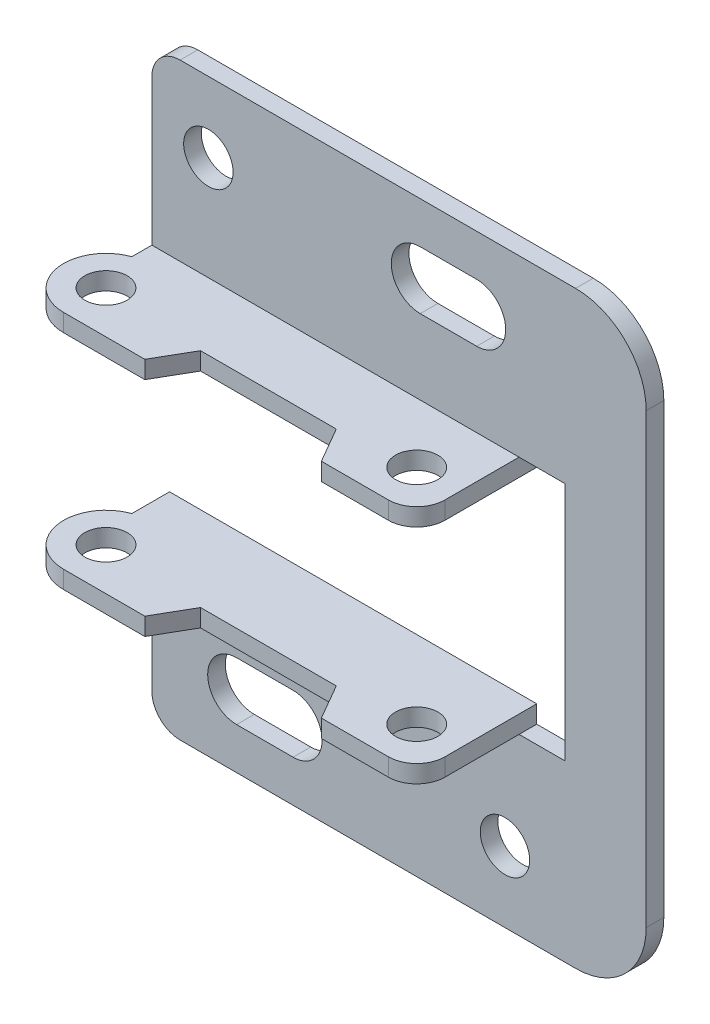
ISO-10303-21;
HEADER;
FILE_DESCRIPTION(('STEP AP214'),'2;1');
FILE_NAME('part.step','',(''),(''),'','','');
FILE_SCHEMA(('AUTOMOTIVE_DESIGN { 1 0 10303 214 1 1 1 1 }'));
ENDSEC;
DATA;
#1=APPLICATION_CONTEXT('core data for automotive mechanical design processes');
#2=APPLICATION_PROTOCOL_DEFINITION('international standard','automotive_design',2000,#1);
#3=PRODUCT_CONTEXT('',#1,'mechanical');
#4=PRODUCT('Part','Part','',(#3));
#5=PRODUCT_RELATED_PRODUCT_CATEGORY('part','',(#4));
#6=PRODUCT_DEFINITION_FORMATION('','',#4);
#7=PRODUCT_DEFINITION_CONTEXT('part definition',#1,'design');
#8=PRODUCT_DEFINITION('design','',#6,#7);
#9=PRODUCT_DEFINITION_SHAPE('','',#8);
#10=(LENGTH_UNIT() NAMED_UNIT(*) SI_UNIT(.MILLI.,.METRE.));
#11=(NAMED_UNIT(*) PLANE_ANGLE_UNIT() SI_UNIT($,.RADIAN.));
#12=(NAMED_UNIT(*) SI_UNIT($,.STERADIAN.) SOLID_ANGLE_UNIT());
#13=UNCERTAINTY_MEASURE_WITH_UNIT(LENGTH_MEASURE(1.E-05),#10,'distance_accuracy_value','');
#14=(GEOMETRIC_REPRESENTATION_CONTEXT(3) GLOBAL_UNCERTAINTY_ASSIGNED_CONTEXT((#13)) GLOBAL_UNIT_ASSIGNED_CONTEXT((#10,
#11,#12)) REPRESENTATION_CONTEXT('',''));
#15=CARTESIAN_POINT('',(0.,0.,0.));
#16=DIRECTION('',(0.,0.,1.));
#17=DIRECTION('',(1.,0.,0.));
#18=AXIS2_PLACEMENT_3D('',#15,#16,#17);
#19=CARTESIAN_POINT('',(12.4450079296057,-8.50000000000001,3.95040388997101));
#20=DIRECTION('',(0.,1.,0.));
#21=DIRECTION('',(0.,0.,1.));
#22=AXIS2_PLACEMENT_3D('',#19,#20,#21);
#23=PLANE('',#22);
#24=CARTESIAN_POINT('',(23.,-8.5,5.5));
#25=DIRECTION('',(0.,1.,0.));
#26=DIRECTION('',(0.,0.,1.));
#27=AXIS2_PLACEMENT_3D('',#24,#25,#26);
#28=CIRCLE('',#27,1.5);
#29=CARTESIAN_POINT('',(23.,-8.5,7.));
#30=VERTEX_POINT('',#29);
#31=EDGE_CURVE('E468',#30,#30,#28,.T.);
#32=ORIENTED_EDGE('',*,*,#31,.T.);
#33=EDGE_LOOP('',(#32));
#34=FACE_BOUND('',#33,.T.);
#35=CARTESIAN_POINT('',(1.,-8.50000000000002,5.5));
#36=DIRECTION('',(0.,1.,0.));
#37=DIRECTION('',(-1.,0.,0.));
#38=AXIS2_PLACEMENT_3D('',#35,#36,#37);
#39=CIRCLE('',#38,1.5);
#40=CARTESIAN_POINT('',(-0.499999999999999,-8.50000000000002,5.5));
#41=VERTEX_POINT('',#40);
#42=EDGE_CURVE('E267',#41,#41,#39,.T.);
#43=ORIENTED_EDGE('',*,*,#42,.T.);
#44=EDGE_LOOP('',(#43));
#45=FACE_BOUND('',#44,.T.);
#46=DIRECTION('',(0.,0.,-1.));
#47=VECTOR('',#46,1.);
#48=CARTESIAN_POINT('',(26.,-8.5,0.));
#49=LINE('',#48,#47);
#50=CARTESIAN_POINT('',(26.,-8.5,6.5));
#51=VERTEX_POINT('',#50);
#52=CARTESIAN_POINT('',(26.,-8.50000000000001,1.25));
#53=VERTEX_POINT('',#52);
#54=EDGE_CURVE('E307',#51,#53,#49,.T.);
#55=ORIENTED_EDGE('',*,*,#54,.F.);
#56=CARTESIAN_POINT('',(24.,-8.5,6.5));
#57=DIRECTION('',(0.,1.,0.));
#58=DIRECTION('',(0.,0.,1.));
#59=AXIS2_PLACEMENT_3D('',#56,#57,#58);
#60=CIRCLE('',#59,2.);
#61=CARTESIAN_POINT('',(24.,-8.5,8.5));
#62=VERTEX_POINT('',#61);
#63=EDGE_CURVE('E268',#62,#51,#60,.T.);
#64=ORIENTED_EDGE('',*,*,#63,.F.);
#65=DIRECTION('',(1.,0.,0.));
#66=VECTOR('',#65,1.);
#67=CARTESIAN_POINT('',(24.,-8.50000000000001,8.5));
#68=LINE('',#67,#66);
#69=CARTESIAN_POINT('',(19.25,-8.50000000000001,8.5));
#70=VERTEX_POINT('',#69);
#71=EDGE_CURVE('E272',#70,#62,#68,.T.);
#72=ORIENTED_EDGE('',*,*,#71,.F.);
#73=DIRECTION('',(0.5,0.,0.866025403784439));
#74=VECTOR('',#73,1.);
#75=CARTESIAN_POINT('',(19.25,-8.50000000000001,8.5));
#76=LINE('',#75,#74);
#77=CARTESIAN_POINT('',(17.8066243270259,-8.50000000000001,6.));
#78=VERTEX_POINT('',#77);
#79=EDGE_CURVE('E276',#78,#70,#76,.T.);
#80=ORIENTED_EDGE('',*,*,#79,.F.);
#81=DIRECTION('',(1.,0.,0.));
#82=VECTOR('',#81,1.);
#83=CARTESIAN_POINT('',(17.8066243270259,-8.50000000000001,6.));
#84=LINE('',#83,#82);
#85=CARTESIAN_POINT('',(8.19337567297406,-8.50000000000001,6.));
#86=VERTEX_POINT('',#85);
#87=EDGE_CURVE('E285',#86,#78,#84,.T.);
#88=ORIENTED_EDGE('',*,*,#87,.F.);
#89=DIRECTION('',(0.499999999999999,0.,-0.866025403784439));
#90=VECTOR('',#89,1.);
#91=CARTESIAN_POINT('',(8.19337567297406,-8.50000000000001,6.));
#92=LINE('',#91,#90);
#93=CARTESIAN_POINT('',(6.75,-8.50000000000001,8.5));
#94=VERTEX_POINT('',#93);
#95=EDGE_CURVE('E292',#94,#86,#92,.T.);
#96=ORIENTED_EDGE('',*,*,#95,.F.);
#97=DIRECTION('',(1.,0.,0.));
#98=VECTOR('',#97,1.);
#99=CARTESIAN_POINT('',(6.75,-8.50000000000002,8.5));
#100=LINE('',#99,#98);
#101=CARTESIAN_POINT('',(1.,-8.50000000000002,8.5));
#102=VERTEX_POINT('',#101);
#103=EDGE_CURVE('E299',#102,#94,#100,.T.);
#104=ORIENTED_EDGE('',*,*,#103,.F.);
#105=CARTESIAN_POINT('',(1.,-8.50000000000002,5.5));
#106=DIRECTION('',(0.,1.,0.));
#107=DIRECTION('',(0.,0.,1.));
#108=AXIS2_PLACEMENT_3D('',#105,#106,#107);
#109=CIRCLE('',#108,2.99999999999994);
#110=CARTESIAN_POINT('',(0.,-8.50000000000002,2.67157287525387));
#111=VERTEX_POINT('',#110);
#112=EDGE_CURVE('E20',#111,#102,#109,.T.);
#113=ORIENTED_EDGE('',*,*,#112,.F.);
#114=DIRECTION('',(0.,0.,1.));
#115=VECTOR('',#114,1.);
#116=CARTESIAN_POINT('',(0.,-8.50000000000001,3.95040388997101));
#117=LINE('',#116,#115);
#118=CARTESIAN_POINT('',(0.,-8.50000000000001,1.25));
#119=VERTEX_POINT('',#118);
#120=EDGE_CURVE('E226',#119,#111,#117,.T.);
#121=ORIENTED_EDGE('',*,*,#120,.F.);
#122=DIRECTION('',(1.,0.,0.));
#123=VECTOR('',#122,1.);
#124=CARTESIAN_POINT('',(18.8605477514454,-8.5,1.25));
#125=LINE('',#124,#123);
#126=EDGE_CURVE('E229',#53,#119,#125,.F.);
#127=ORIENTED_EDGE('',*,*,#126,.F.);
#128=EDGE_LOOP('',(#55,#64,#72,#80,#88,#96,#104,#113,#121,#127));
#129=FACE_BOUND('',#128,.T.);
#130=ADVANCED_FACE('F16',(#34,#45,#129),#23,.F.);
#131=CARTESIAN_POINT('',(26.,8.5,1.25));
#132=DIRECTION('',(0.,-1.,0.));
#133=DIRECTION('',(0.,0.,1.));
#134=AXIS2_PLACEMENT_3D('',#131,#132,#133);
#135=PLANE('',#134);
#136=CARTESIAN_POINT('',(1.,8.50000000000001,5.5));
#137=DIRECTION('',(0.,-1.,0.));
#138=DIRECTION('',(0.,0.,-1.));
#139=AXIS2_PLACEMENT_3D('',#136,#137,#138);
#140=CIRCLE('',#139,1.5);
#141=CARTESIAN_POINT('',(1.,8.50000000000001,4.));
#142=VERTEX_POINT('',#141);
#143=EDGE_CURVE('E460',#142,#142,#140,.T.);
#144=ORIENTED_EDGE('',*,*,#143,.T.);
#145=EDGE_LOOP('',(#144));
#146=FACE_BOUND('',#145,.T.);
#147=CARTESIAN_POINT('',(23.,8.5,5.5));
#148=DIRECTION('',(0.,-1.,0.));
#149=DIRECTION('',(0.,0.,-1.));
#150=AXIS2_PLACEMENT_3D('',#147,#148,#149);
#151=CIRCLE('',#150,1.5);
#152=CARTESIAN_POINT('',(23.,8.5,4.));
#153=VERTEX_POINT('',#152);
#154=EDGE_CURVE('E247',#153,#153,#151,.T.);
#155=ORIENTED_EDGE('',*,*,#154,.T.);
#156=EDGE_LOOP('',(#155));
#157=FACE_BOUND('',#156,.T.);
#158=DIRECTION('',(0.,0.,-1.));
#159=VECTOR('',#158,1.);
#160=CARTESIAN_POINT('',(0.,8.50000000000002,4.875));
#161=LINE('',#160,#159);
#162=CARTESIAN_POINT('',(0.,8.50000000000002,2.67157287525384));
#163=VERTEX_POINT('',#162);
#164=CARTESIAN_POINT('',(0.,8.50000000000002,1.25));
#165=VERTEX_POINT('',#164);
#166=EDGE_CURVE('E233',#163,#165,#161,.T.);
#167=ORIENTED_EDGE('',*,*,#166,.F.);
#168=CARTESIAN_POINT('',(1.,8.50000000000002,5.5));
#169=DIRECTION('',(0.,-1.,0.));
#170=DIRECTION('',(0.,0.,-1.));
#171=AXIS2_PLACEMENT_3D('',#168,#169,#170);
#172=CIRCLE('',#171,2.99999999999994);
#173=CARTESIAN_POINT('',(1.,8.50000000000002,8.49999999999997));
#174=VERTEX_POINT('',#173);
#175=EDGE_CURVE('E463',#174,#163,#172,.T.);
#176=ORIENTED_EDGE('',*,*,#175,.F.);
#177=DIRECTION('',(-1.,0.,0.));
#178=VECTOR('',#177,1.);
#179=CARTESIAN_POINT('',(3.875,8.50000000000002,8.5));
#180=LINE('',#179,#178);
#181=CARTESIAN_POINT('',(6.75,8.50000000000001,8.5));
#182=VERTEX_POINT('',#181);
#183=EDGE_CURVE('E316',#182,#174,#180,.T.);
#184=ORIENTED_EDGE('',*,*,#183,.F.);
#185=DIRECTION('',(-0.5,0.,0.866025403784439));
#186=VECTOR('',#185,1.);
#187=CARTESIAN_POINT('',(7.47168783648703,8.50000000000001,7.25));
#188=LINE('',#187,#186);
#189=CARTESIAN_POINT('',(8.19337567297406,8.50000000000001,6.));
#190=VERTEX_POINT('',#189);
#191=EDGE_CURVE('E320',#190,#182,#188,.T.);
#192=ORIENTED_EDGE('',*,*,#191,.F.);
#193=DIRECTION('',(-1.,0.,0.));
#194=VECTOR('',#193,1.);
#195=CARTESIAN_POINT('',(13.,8.50000000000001,6.));
#196=LINE('',#195,#194);
#197=CARTESIAN_POINT('',(17.8066243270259,8.50000000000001,6.));
#198=VERTEX_POINT('',#197);
#199=EDGE_CURVE('E324',#198,#190,#196,.T.);
#200=ORIENTED_EDGE('',*,*,#199,.F.);
#201=DIRECTION('',(-0.499999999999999,0.,-0.866025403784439));
#202=VECTOR('',#201,1.);
#203=CARTESIAN_POINT('',(18.528312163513,8.50000000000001,7.25));
#204=LINE('',#203,#202);
#205=CARTESIAN_POINT('',(19.25,8.50000000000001,8.5));
#206=VERTEX_POINT('',#205);
#207=EDGE_CURVE('E328',#206,#198,#204,.T.);
#208=ORIENTED_EDGE('',*,*,#207,.F.);
#209=DIRECTION('',(-1.,0.,0.));
#210=VECTOR('',#209,1.);
#211=CARTESIAN_POINT('',(21.625,8.5,8.5));
#212=LINE('',#211,#210);
#213=CARTESIAN_POINT('',(24.,8.5,8.5));
#214=VERTEX_POINT('',#213);
#215=EDGE_CURVE('E332',#214,#206,#212,.T.);
#216=ORIENTED_EDGE('',*,*,#215,.F.);
#217=CARTESIAN_POINT('',(24.,8.5,6.50000000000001));
#218=DIRECTION('',(0.,-1.,0.));
#219=DIRECTION('',(0.,0.,-1.));
#220=AXIS2_PLACEMENT_3D('',#217,#218,#219);
#221=CIRCLE('',#220,2.);
#222=CARTESIAN_POINT('',(26.,8.5,6.50000000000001));
#223=VERTEX_POINT('',#222);
#224=EDGE_CURVE('E466',#223,#214,#221,.T.);
#225=ORIENTED_EDGE('',*,*,#224,.F.);
#226=DIRECTION('',(0.,0.,1.));
#227=VECTOR('',#226,1.);
#228=CARTESIAN_POINT('',(26.,8.5,3.25));
#229=LINE('',#228,#227);
#230=CARTESIAN_POINT('',(26.,8.50000000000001,1.25));
#231=VERTEX_POINT('',#230);
#232=EDGE_CURVE('E336',#231,#223,#229,.T.);
#233=ORIENTED_EDGE('',*,*,#232,.F.);
#234=DIRECTION('',(1.,0.,0.));
#235=VECTOR('',#234,1.);
#236=CARTESIAN_POINT('',(18.8605477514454,8.50000000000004,1.25));
#237=LINE('',#236,#235);
#238=EDGE_CURVE('E246',#165,#231,#237,.T.);
#239=ORIENTED_EDGE('',*,*,#238,.F.);
#240=EDGE_LOOP('',(#167,#176,#184,#192,#200,#208,#216,#225,#233,#239));
#241=FACE_BOUND('',#240,.T.);
#242=ADVANCED_FACE('F1010',(#146,#157,#241),#135,.F.);
#243=CARTESIAN_POINT('',(26.,-8.5,0.));
#244=DIRECTION('',(1.,0.,0.));
#245=DIRECTION('',(0.,0.,-1.));
#246=AXIS2_PLACEMENT_3D('',#243,#244,#245);
#247=PLANE('',#246);
#248=DIRECTION('',(0.,0.,-1.));
#249=VECTOR('',#248,1.);
#250=CARTESIAN_POINT('',(26.,-8.5,0.));
#251=LINE('',#250,#249);
#252=CARTESIAN_POINT('',(26.,-8.5,0.));
#253=VERTEX_POINT('',#252);
#254=EDGE_CURVE('E215',#53,#253,#251,.T.);
#255=ORIENTED_EDGE('',*,*,#254,.T.);
#256=DIRECTION('',(0.,1.,0.));
#257=VECTOR('',#256,1.);
#258=CARTESIAN_POINT('',(26.,-8.5,0.));
#259=LINE('',#258,#257);
#260=CARTESIAN_POINT('',(26.,-7.25000000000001,0.));
#261=VERTEX_POINT('',#260);
#262=EDGE_CURVE('E304',#253,#261,#259,.T.);
#263=ORIENTED_EDGE('',*,*,#262,.T.);
#264=DIRECTION('',(0.,0.,1.));
#265=VECTOR('',#264,1.);
#266=CARTESIAN_POINT('',(26.,-7.25000000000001,3.95040388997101));
#267=LINE('',#266,#265);
#268=CARTESIAN_POINT('',(26.,-7.25000000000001,6.5));
#269=VERTEX_POINT('',#268);
#270=EDGE_CURVE('E457',#269,#261,#267,.F.);
#271=ORIENTED_EDGE('',*,*,#270,.F.);
#272=DIRECTION('',(0.,1.,0.));
#273=VECTOR('',#272,1.);
#274=CARTESIAN_POINT('',(26.,-8.5,6.5));
#275=LINE('',#274,#273);
#276=EDGE_CURVE('E265',#51,#269,#275,.T.);
#277=ORIENTED_EDGE('',*,*,#276,.F.);
#278=ORIENTED_EDGE('',*,*,#54,.T.);
#279=EDGE_LOOP('',(#255,#263,#271,#277,#278));
#280=FACE_BOUND('',#279,.T.);
#281=ADVANCED_FACE('F480',(#280),#247,.T.);
#282=CARTESIAN_POINT('',(1.,-8.50000000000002,5.5));
#283=DIRECTION('',(0.,1.,0.));
#284=DIRECTION('',(0.,0.,1.));
#285=AXIS2_PLACEMENT_3D('',#282,#283,#284);
#286=CYLINDRICAL_SURFACE('',#285,2.99999999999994);
#287=ORIENTED_EDGE('',*,*,#112,.T.);
#288=DIRECTION('',(0.,1.,0.));
#289=VECTOR('',#288,1.);
#290=CARTESIAN_POINT('',(0.999999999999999,-8.50000000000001,8.5));
#291=LINE('',#290,#289);
#292=CARTESIAN_POINT('',(1.,-7.25000000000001,8.5));
#293=VERTEX_POINT('',#292);
#294=EDGE_CURVE('E300',#293,#102,#291,.F.);
#295=ORIENTED_EDGE('',*,*,#294,.F.);
#296=CARTESIAN_POINT('',(1.,-7.25000000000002,5.5));
#297=DIRECTION('',(0.,1.,0.));
#298=DIRECTION('',(0.,0.,1.));
#299=AXIS2_PLACEMENT_3D('',#296,#297,#298);
#300=CIRCLE('',#299,2.99999999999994);
#301=CARTESIAN_POINT('',(0.,-7.25000000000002,2.67157287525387));
#302=VERTEX_POINT('',#301);
#303=EDGE_CURVE('E455',#302,#293,#300,.T.);
#304=ORIENTED_EDGE('',*,*,#303,.F.);
#305=DIRECTION('',(0.,1.,0.));
#306=VECTOR('',#305,1.);
#307=CARTESIAN_POINT('',(0.,-8.50000000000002,2.67157287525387));
#308=LINE('',#307,#306);
#309=EDGE_CURVE('E205',#302,#111,#308,.F.);
#310=ORIENTED_EDGE('',*,*,#309,.T.);
#311=EDGE_LOOP('',(#287,#295,#304,#310));
#312=FACE_BOUND('',#311,.T.);
#313=ADVANCED_FACE('F1020',(#312),#286,.T.);
#314=CARTESIAN_POINT('',(6.75,-8.50000000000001,8.5));
#315=DIRECTION('',(0.,0.,1.));
#316=DIRECTION('',(1.,0.,0.));
#317=AXIS2_PLACEMENT_3D('',#314,#315,#316);
#318=PLANE('',#317);
#319=ORIENTED_EDGE('',*,*,#103,.T.);
#320=DIRECTION('',(0.,1.,0.));
#321=VECTOR('',#320,1.);
#322=CARTESIAN_POINT('',(6.75,-8.50000000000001,8.5));
#323=LINE('',#322,#321);
#324=CARTESIAN_POINT('',(6.75,-7.25000000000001,8.5));
#325=VERTEX_POINT('',#324);
#326=EDGE_CURVE('E296',#325,#94,#323,.F.);
#327=ORIENTED_EDGE('',*,*,#326,.F.);
#328=DIRECTION('',(1.,0.,0.));
#329=VECTOR('',#328,1.);
#330=CARTESIAN_POINT('',(12.4450079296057,-7.25000000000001,8.5));
#331=LINE('',#330,#329);
#332=EDGE_CURVE('E295',#293,#325,#331,.T.);
#333=ORIENTED_EDGE('',*,*,#332,.F.);
#334=ORIENTED_EDGE('',*,*,#294,.T.);
#335=EDGE_LOOP('',(#319,#327,#333,#334));
#336=FACE_BOUND('',#335,.T.);
#337=ADVANCED_FACE('F562',(#336),#318,.T.);
#338=CARTESIAN_POINT('',(8.19337567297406,-8.50000000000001,6.));
#339=DIRECTION('',(0.866025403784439,0.,0.499999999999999));
#340=DIRECTION('',(0.499999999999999,0.,-0.866025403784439));
#341=AXIS2_PLACEMENT_3D('',#338,#339,#340);
#342=PLANE('',#341);
#343=ORIENTED_EDGE('',*,*,#95,.T.);
#344=DIRECTION('',(0.,1.,0.));
#345=VECTOR('',#344,1.);
#346=CARTESIAN_POINT('',(8.19337567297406,-8.50000000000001,6.));
#347=LINE('',#346,#345);
#348=CARTESIAN_POINT('',(8.19337567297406,-7.25000000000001,6.));
#349=VERTEX_POINT('',#348);
#350=EDGE_CURVE('E289',#349,#86,#347,.F.);
#351=ORIENTED_EDGE('',*,*,#350,.F.);
#352=DIRECTION('',(0.5,0.,-0.866025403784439));
#353=VECTOR('',#352,1.);
#354=CARTESIAN_POINT('',(6.75,-7.25000000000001,8.5));
#355=LINE('',#354,#353);
#356=EDGE_CURVE('E288',#325,#349,#355,.T.);
#357=ORIENTED_EDGE('',*,*,#356,.F.);
#358=ORIENTED_EDGE('',*,*,#326,.T.);
#359=EDGE_LOOP('',(#343,#351,#357,#358));
#360=FACE_BOUND('',#359,.T.);
#361=ADVANCED_FACE('F568',(#360),#342,.T.);
#362=CARTESIAN_POINT('',(17.8066243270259,-8.50000000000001,6.));
#363=DIRECTION('',(0.,0.,1.));
#364=DIRECTION('',(1.,0.,0.));
#365=AXIS2_PLACEMENT_3D('',#362,#363,#364);
#366=PLANE('',#365);
#367=ORIENTED_EDGE('',*,*,#87,.T.);
#368=DIRECTION('',(0.,1.,0.));
#369=VECTOR('',#368,1.);
#370=CARTESIAN_POINT('',(17.8066243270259,-8.50000000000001,6.));
#371=LINE('',#370,#369);
#372=CARTESIAN_POINT('',(17.8066243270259,-7.25000000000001,6.));
#373=VERTEX_POINT('',#372);
#374=EDGE_CURVE('E282',#373,#78,#371,.F.);
#375=ORIENTED_EDGE('',*,*,#374,.F.);
#376=DIRECTION('',(1.,0.,0.));
#377=VECTOR('',#376,1.);
#378=CARTESIAN_POINT('',(12.4450079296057,-7.25000000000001,6.));
#379=LINE('',#378,#377);
#380=EDGE_CURVE('E281',#349,#373,#379,.T.);
#381=ORIENTED_EDGE('',*,*,#380,.F.);
#382=ORIENTED_EDGE('',*,*,#350,.T.);
#383=EDGE_LOOP('',(#367,#375,#381,#382));
#384=FACE_BOUND('',#383,.T.);
#385=ADVANCED_FACE('F572',(#384),#366,.T.);
#386=CARTESIAN_POINT('',(19.25,-8.50000000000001,8.5));
#387=DIRECTION('',(-0.866025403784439,0.,0.5));
#388=DIRECTION('',(0.5,0.,0.866025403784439));
#389=AXIS2_PLACEMENT_3D('',#386,#387,#388);
#390=PLANE('',#389);
#391=ORIENTED_EDGE('',*,*,#79,.T.);
#392=DIRECTION('',(0.,1.,0.));
#393=VECTOR('',#392,1.);
#394=CARTESIAN_POINT('',(19.25,-8.5,8.5));
#395=LINE('',#394,#393);
#396=CARTESIAN_POINT('',(19.25,-7.25000000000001,8.5));
#397=VERTEX_POINT('',#396);
#398=EDGE_CURVE('E273',#397,#70,#395,.F.);
#399=ORIENTED_EDGE('',*,*,#398,.F.);
#400=DIRECTION('',(0.499999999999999,0.,0.866025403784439));
#401=VECTOR('',#400,1.);
#402=CARTESIAN_POINT('',(17.8066243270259,-7.25000000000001,6.));
#403=LINE('',#402,#401);
#404=EDGE_CURVE('E277',#373,#397,#403,.T.);
#405=ORIENTED_EDGE('',*,*,#404,.F.);
#406=ORIENTED_EDGE('',*,*,#374,.T.);
#407=EDGE_LOOP('',(#391,#399,#405,#406));
#408=FACE_BOUND('',#407,.T.);
#409=ADVANCED_FACE('F574',(#408),#390,.T.);
#410=CARTESIAN_POINT('',(24.,-8.5,8.5));
#411=DIRECTION('',(0.,0.,1.));
#412=DIRECTION('',(1.,0.,0.));
#413=AXIS2_PLACEMENT_3D('',#410,#411,#412);
#414=PLANE('',#413);
#415=ORIENTED_EDGE('',*,*,#71,.T.);
#416=DIRECTION('',(0.,1.,0.));
#417=VECTOR('',#416,1.);
#418=CARTESIAN_POINT('',(24.,-8.5,8.5));
#419=LINE('',#418,#417);
#420=CARTESIAN_POINT('',(24.,-7.25000000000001,8.5));
#421=VERTEX_POINT('',#420);
#422=EDGE_CURVE('E269',#421,#62,#419,.F.);
#423=ORIENTED_EDGE('',*,*,#422,.F.);
#424=DIRECTION('',(1.,0.,0.));
#425=VECTOR('',#424,1.);
#426=CARTESIAN_POINT('',(12.4450079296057,-7.25000000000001,8.5));
#427=LINE('',#426,#425);
#428=EDGE_CURVE('E280',#397,#421,#427,.T.);
#429=ORIENTED_EDGE('',*,*,#428,.F.);
#430=ORIENTED_EDGE('',*,*,#398,.T.);
#431=EDGE_LOOP('',(#415,#423,#429,#430));
#432=FACE_BOUND('',#431,.T.);
#433=ADVANCED_FACE('F543',(#432),#414,.T.);
#434=CARTESIAN_POINT('',(24.,-8.5,6.5));
#435=DIRECTION('',(0.,1.,0.));
#436=DIRECTION('',(0.,0.,1.));
#437=AXIS2_PLACEMENT_3D('',#434,#435,#436);
#438=CYLINDRICAL_SURFACE('',#437,2.);
#439=ORIENTED_EDGE('',*,*,#63,.T.);
#440=ORIENTED_EDGE('',*,*,#276,.T.);
#441=CARTESIAN_POINT('',(24.,-7.25,6.5));
#442=DIRECTION('',(0.,1.,0.));
#443=DIRECTION('',(0.,0.,1.));
#444=AXIS2_PLACEMENT_3D('',#441,#442,#443);
#445=CIRCLE('',#444,2.);
#446=EDGE_CURVE('E452',#421,#269,#445,.T.);
#447=ORIENTED_EDGE('',*,*,#446,.F.);
#448=ORIENTED_EDGE('',*,*,#422,.T.);
#449=EDGE_LOOP('',(#439,#440,#447,#448));
#450=FACE_BOUND('',#449,.T.);
#451=ADVANCED_FACE('F474',(#450),#438,.T.);
#452=CARTESIAN_POINT('',(1.,-8.50000000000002,5.5));
#453=DIRECTION('',(0.,1.,0.));
#454=DIRECTION('',(-1.,0.,0.));
#455=AXIS2_PLACEMENT_3D('',#452,#453,#454);
#456=CYLINDRICAL_SURFACE('',#455,1.5);
#457=ORIENTED_EDGE('',*,*,#42,.F.);
#458=EDGE_LOOP('',(#457));
#459=FACE_BOUND('',#458,.T.);
#460=CARTESIAN_POINT('',(1.,-7.25000000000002,5.5));
#461=DIRECTION('',(0.,1.,0.));
#462=DIRECTION('',(-1.,0.,0.));
#463=AXIS2_PLACEMENT_3D('',#460,#461,#462);
#464=CIRCLE('',#463,1.5);
#465=CARTESIAN_POINT('',(-0.5,-7.25000000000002,5.5));
#466=VERTEX_POINT('',#465);
#467=EDGE_CURVE('E259',#466,#466,#464,.F.);
#468=ORIENTED_EDGE('',*,*,#467,.F.);
#469=EDGE_LOOP('',(#468));
#470=FACE_BOUND('',#469,.T.);
#471=ADVANCED_FACE('F687',(#459,#470),#456,.F.);
#472=CARTESIAN_POINT('',(23.,-8.5,5.5));
#473=DIRECTION('',(0.,1.,0.));
#474=DIRECTION('',(0.,0.,1.));
#475=AXIS2_PLACEMENT_3D('',#472,#473,#474);
#476=CYLINDRICAL_SURFACE('',#475,1.5);
#477=ORIENTED_EDGE('',*,*,#31,.F.);
#478=EDGE_LOOP('',(#477));
#479=FACE_BOUND('',#478,.T.);
#480=CARTESIAN_POINT('',(23.,-7.25,5.5));
#481=DIRECTION('',(0.,1.,0.));
#482=DIRECTION('',(0.,0.,1.));
#483=AXIS2_PLACEMENT_3D('',#480,#481,#482);
#484=CIRCLE('',#483,1.5);
#485=CARTESIAN_POINT('',(23.,-7.25,7.));
#486=VERTEX_POINT('',#485);
#487=EDGE_CURVE('E253',#486,#486,#484,.F.);
#488=ORIENTED_EDGE('',*,*,#487,.F.);
#489=EDGE_LOOP('',(#488));
#490=FACE_BOUND('',#489,.T.);
#491=ADVANCED_FACE('F683',(#479,#490),#476,.F.);
#492=CARTESIAN_POINT('',(26.,7.25,6.5));
#493=DIRECTION('',(1.,0.,0.));
#494=DIRECTION('',(0.,0.,-1.));
#495=AXIS2_PLACEMENT_3D('',#492,#493,#494);
#496=PLANE('',#495);
#497=ORIENTED_EDGE('',*,*,#232,.T.);
#498=DIRECTION('',(0.,1.,0.));
#499=VECTOR('',#498,1.);
#500=CARTESIAN_POINT('',(26.,7.875,6.5));
#501=LINE('',#500,#499);
#502=CARTESIAN_POINT('',(26.,7.25,6.50000000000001));
#503=VERTEX_POINT('',#502);
#504=EDGE_CURVE('E338',#503,#223,#501,.T.);
#505=ORIENTED_EDGE('',*,*,#504,.F.);
#506=DIRECTION('',(0.,0.,1.));
#507=VECTOR('',#506,1.);
#508=CARTESIAN_POINT('',(26.,7.25,4.25));
#509=LINE('',#508,#507);
#510=CARTESIAN_POINT('',(26.,7.25000000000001,0.));
#511=VERTEX_POINT('',#510);
#512=EDGE_CURVE('E436',#511,#503,#509,.T.);
#513=ORIENTED_EDGE('',*,*,#512,.F.);
#514=DIRECTION('',(0.,1.,0.));
#515=VECTOR('',#514,1.);
#516=CARTESIAN_POINT('',(26.,7.875,0.));
#517=LINE('',#516,#515);
#518=CARTESIAN_POINT('',(26.,8.5,0.));
#519=VERTEX_POINT('',#518);
#520=EDGE_CURVE('E342',#511,#519,#517,.T.);
#521=ORIENTED_EDGE('',*,*,#520,.T.);
#522=DIRECTION('',(0.,0.,1.));
#523=VECTOR('',#522,1.);
#524=CARTESIAN_POINT('',(26.,8.5,3.25));
#525=LINE('',#524,#523);
#526=EDGE_CURVE('E339',#519,#231,#525,.T.);
#527=ORIENTED_EDGE('',*,*,#526,.T.);
#528=EDGE_LOOP('',(#497,#505,#513,#521,#527));
#529=FACE_BOUND('',#528,.T.);
#530=ADVANCED_FACE('F686',(#529),#496,.T.);
#531=CARTESIAN_POINT('',(24.,8.5,6.50000000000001));
#532=DIRECTION('',(0.,-1.,0.));
#533=DIRECTION('',(0.,0.,-1.));
#534=AXIS2_PLACEMENT_3D('',#531,#532,#533);
#535=CYLINDRICAL_SURFACE('',#534,2.);
#536=ORIENTED_EDGE('',*,*,#224,.T.);
#537=DIRECTION('',(0.,1.,0.));
#538=VECTOR('',#537,1.);
#539=CARTESIAN_POINT('',(24.,7.875,8.5));
#540=LINE('',#539,#538);
#541=CARTESIAN_POINT('',(24.,7.25,8.5));
#542=VERTEX_POINT('',#541);
#543=EDGE_CURVE('E335',#542,#214,#540,.T.);
#544=ORIENTED_EDGE('',*,*,#543,.F.);
#545=CARTESIAN_POINT('',(24.,7.25,6.50000000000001));
#546=DIRECTION('',(0.,-1.,0.));
#547=DIRECTION('',(0.,0.,-1.));
#548=AXIS2_PLACEMENT_3D('',#545,#546,#547);
#549=CIRCLE('',#548,2.);
#550=EDGE_CURVE('E434',#503,#542,#549,.T.);
#551=ORIENTED_EDGE('',*,*,#550,.F.);
#552=ORIENTED_EDGE('',*,*,#504,.T.);
#553=EDGE_LOOP('',(#536,#544,#551,#552));
#554=FACE_BOUND('',#553,.T.);
#555=ADVANCED_FACE('F714',(#554),#535,.T.);
#556=CARTESIAN_POINT('',(19.25,7.25,8.5));
#557=DIRECTION('',(0.,0.,1.));
#558=DIRECTION('',(1.,0.,0.));
#559=AXIS2_PLACEMENT_3D('',#556,#557,#558);
#560=PLANE('',#559);
#561=ORIENTED_EDGE('',*,*,#215,.T.);
#562=DIRECTION('',(0.,1.,0.));
#563=VECTOR('',#562,1.);
#564=CARTESIAN_POINT('',(19.25,7.87500000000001,8.5));
#565=LINE('',#564,#563);
#566=CARTESIAN_POINT('',(19.25,7.25000000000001,8.5));
#567=VERTEX_POINT('',#566);
#568=EDGE_CURVE('E331',#567,#206,#565,.T.);
#569=ORIENTED_EDGE('',*,*,#568,.F.);
#570=DIRECTION('',(-1.,0.,0.));
#571=VECTOR('',#570,1.);
#572=CARTESIAN_POINT('',(11.86,7.25000000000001,8.5));
#573=LINE('',#572,#571);
#574=EDGE_CURVE('E433',#542,#567,#573,.T.);
#575=ORIENTED_EDGE('',*,*,#574,.F.);
#576=ORIENTED_EDGE('',*,*,#543,.T.);
#577=EDGE_LOOP('',(#561,#569,#575,#576));
#578=FACE_BOUND('',#577,.T.);
#579=ADVANCED_FACE('F722',(#578),#560,.T.);
#580=CARTESIAN_POINT('',(17.8066243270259,7.25000000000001,6.));
#581=DIRECTION('',(-0.866025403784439,0.,0.499999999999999));
#582=DIRECTION('',(0.499999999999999,0.,0.866025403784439));
#583=AXIS2_PLACEMENT_3D('',#580,#581,#582);
#584=PLANE('',#583);
#585=ORIENTED_EDGE('',*,*,#207,.T.);
#586=DIRECTION('',(0.,1.,0.));
#587=VECTOR('',#586,1.);
#588=CARTESIAN_POINT('',(17.8066243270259,7.87500000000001,6.));
#589=LINE('',#588,#587);
#590=CARTESIAN_POINT('',(17.8066243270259,7.25000000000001,6.));
#591=VERTEX_POINT('',#590);
#592=EDGE_CURVE('E327',#591,#198,#589,.T.);
#593=ORIENTED_EDGE('',*,*,#592,.F.);
#594=DIRECTION('',(-0.499999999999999,0.,-0.866025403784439));
#595=VECTOR('',#594,1.);
#596=CARTESIAN_POINT('',(19.25,7.25000000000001,8.5));
#597=LINE('',#596,#595);
#598=EDGE_CURVE('E431',#567,#591,#597,.T.);
#599=ORIENTED_EDGE('',*,*,#598,.F.);
#600=ORIENTED_EDGE('',*,*,#568,.T.);
#601=EDGE_LOOP('',(#585,#593,#599,#600));
#602=FACE_BOUND('',#601,.T.);
#603=ADVANCED_FACE('F730',(#602),#584,.T.);
#604=CARTESIAN_POINT('',(8.19337567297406,7.25000000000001,6.));
#605=DIRECTION('',(0.,0.,1.));
#606=DIRECTION('',(1.,0.,0.));
#607=AXIS2_PLACEMENT_3D('',#604,#605,#606);
#608=PLANE('',#607);
#609=ORIENTED_EDGE('',*,*,#199,.T.);
#610=DIRECTION('',(0.,1.,0.));
#611=VECTOR('',#610,1.);
#612=CARTESIAN_POINT('',(8.19337567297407,7.87500000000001,6.));
#613=LINE('',#612,#611);
#614=CARTESIAN_POINT('',(8.19337567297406,7.25000000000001,6.));
#615=VERTEX_POINT('',#614);
#616=EDGE_CURVE('E323',#615,#190,#613,.T.);
#617=ORIENTED_EDGE('',*,*,#616,.F.);
#618=DIRECTION('',(-1.,0.,0.));
#619=VECTOR('',#618,1.);
#620=CARTESIAN_POINT('',(11.86,7.25000000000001,6.));
#621=LINE('',#620,#619);
#622=EDGE_CURVE('E430',#591,#615,#621,.T.);
#623=ORIENTED_EDGE('',*,*,#622,.F.);
#624=ORIENTED_EDGE('',*,*,#592,.T.);
#625=EDGE_LOOP('',(#609,#617,#623,#624));
#626=FACE_BOUND('',#625,.T.);
#627=ADVANCED_FACE('F738',(#626),#608,.T.);
#628=CARTESIAN_POINT('',(6.75,7.25000000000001,8.5));
#629=DIRECTION('',(0.866025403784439,0.,0.499999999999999));
#630=DIRECTION('',(0.499999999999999,0.,-0.866025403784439));
#631=AXIS2_PLACEMENT_3D('',#628,#629,#630);
#632=PLANE('',#631);
#633=ORIENTED_EDGE('',*,*,#191,.T.);
#634=DIRECTION('',(0.,1.,0.));
#635=VECTOR('',#634,1.);
#636=CARTESIAN_POINT('',(6.75,7.87500000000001,8.5));
#637=LINE('',#636,#635);
#638=CARTESIAN_POINT('',(6.75,7.25000000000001,8.5));
#639=VERTEX_POINT('',#638);
#640=EDGE_CURVE('E319',#639,#182,#637,.T.);
#641=ORIENTED_EDGE('',*,*,#640,.F.);
#642=DIRECTION('',(-0.499999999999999,0.,0.866025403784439));
#643=VECTOR('',#642,1.);
#644=CARTESIAN_POINT('',(8.19337567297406,7.25000000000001,6.));
#645=LINE('',#644,#643);
#646=EDGE_CURVE('E428',#615,#639,#645,.T.);
#647=ORIENTED_EDGE('',*,*,#646,.F.);
#648=ORIENTED_EDGE('',*,*,#616,.T.);
#649=EDGE_LOOP('',(#633,#641,#647,#648));
#650=FACE_BOUND('',#649,.T.);
#651=ADVANCED_FACE('F746',(#650),#632,.T.);
#652=CARTESIAN_POINT('',(0.999999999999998,7.25000000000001,8.5));
#653=DIRECTION('',(0.,0.,1.));
#654=DIRECTION('',(1.,0.,0.));
#655=AXIS2_PLACEMENT_3D('',#652,#653,#654);
#656=PLANE('',#655);
#657=ORIENTED_EDGE('',*,*,#183,.T.);
#658=DIRECTION('',(0.,1.,0.));
#659=VECTOR('',#658,1.);
#660=CARTESIAN_POINT('',(1.,7.87500000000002,8.49999999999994));
#661=LINE('',#660,#659);
#662=CARTESIAN_POINT('',(1.,7.25000000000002,8.49999999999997));
#663=VERTEX_POINT('',#662);
#664=EDGE_CURVE('E318',#663,#174,#661,.T.);
#665=ORIENTED_EDGE('',*,*,#664,.F.);
#666=DIRECTION('',(-1.,0.,0.));
#667=VECTOR('',#666,1.);
#668=CARTESIAN_POINT('',(11.86,7.25000000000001,8.5));
#669=LINE('',#668,#667);
#670=EDGE_CURVE('E427',#639,#663,#669,.T.);
#671=ORIENTED_EDGE('',*,*,#670,.F.);
#672=ORIENTED_EDGE('',*,*,#640,.T.);
#673=EDGE_LOOP('',(#657,#665,#671,#672));
#674=FACE_BOUND('',#673,.T.);
#675=ADVANCED_FACE('F754',(#674),#656,.T.);
#676=CARTESIAN_POINT('',(1.,8.50000000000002,5.5));
#677=DIRECTION('',(0.,-1.,0.));
#678=DIRECTION('',(0.,0.,-1.));
#679=AXIS2_PLACEMENT_3D('',#676,#677,#678);
#680=CYLINDRICAL_SURFACE('',#679,2.99999999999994);
#681=ORIENTED_EDGE('',*,*,#175,.T.);
#682=DIRECTION('',(0.,1.,0.));
#683=VECTOR('',#682,1.);
#684=CARTESIAN_POINT('',(0.,8.50000000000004,2.67157287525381));
#685=LINE('',#684,#683);
#686=CARTESIAN_POINT('',(0.,7.25000000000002,2.67157287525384));
#687=VERTEX_POINT('',#686);
#688=EDGE_CURVE('E500',#687,#163,#685,.T.);
#689=ORIENTED_EDGE('',*,*,#688,.F.);
#690=CARTESIAN_POINT('',(1.,7.25000000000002,5.5));
#691=DIRECTION('',(0.,-1.,0.));
#692=DIRECTION('',(0.,0.,-1.));
#693=AXIS2_PLACEMENT_3D('',#690,#691,#692);
#694=CIRCLE('',#693,2.99999999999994);
#695=EDGE_CURVE('E425',#663,#687,#694,.T.);
#696=ORIENTED_EDGE('',*,*,#695,.F.);
#697=ORIENTED_EDGE('',*,*,#664,.T.);
#698=EDGE_LOOP('',(#681,#689,#696,#697));
#699=FACE_BOUND('',#698,.T.);
#700=ADVANCED_FACE('F762',(#699),#680,.T.);
#701=CARTESIAN_POINT('',(1.,8.50000000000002,5.5));
#702=DIRECTION('',(0.,-1.,0.));
#703=DIRECTION('',(0.,0.,-1.));
#704=AXIS2_PLACEMENT_3D('',#701,#702,#703);
#705=CYLINDRICAL_SURFACE('',#704,1.5);
#706=ORIENTED_EDGE('',*,*,#143,.F.);
#707=EDGE_LOOP('',(#706));
#708=FACE_BOUND('',#707,.T.);
#709=CARTESIAN_POINT('',(1.,7.25000000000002,5.5));
#710=DIRECTION('',(0.,-1.,0.));
#711=DIRECTION('',(0.,0.,-1.));
#712=AXIS2_PLACEMENT_3D('',#709,#710,#711);
#713=CIRCLE('',#712,1.5);
#714=CARTESIAN_POINT('',(1.,7.25000000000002,4.));
#715=VERTEX_POINT('',#714);
#716=EDGE_CURVE('E421',#715,#715,#713,.F.);
#717=ORIENTED_EDGE('',*,*,#716,.F.);
#718=EDGE_LOOP('',(#717));
#719=FACE_BOUND('',#718,.T.);
#720=ADVANCED_FACE('F770',(#708,#719),#705,.F.);
#721=CARTESIAN_POINT('',(23.,8.50000000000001,5.5));
#722=DIRECTION('',(0.,-1.,0.));
#723=DIRECTION('',(0.,0.,-1.));
#724=AXIS2_PLACEMENT_3D('',#721,#722,#723);
#725=CYLINDRICAL_SURFACE('',#724,1.5);
#726=ORIENTED_EDGE('',*,*,#154,.F.);
#727=EDGE_LOOP('',(#726));
#728=FACE_BOUND('',#727,.T.);
#729=CARTESIAN_POINT('',(23.,7.25,5.5));
#730=DIRECTION('',(0.,-1.,0.));
#731=DIRECTION('',(0.,0.,-1.));
#732=AXIS2_PLACEMENT_3D('',#729,#730,#731);
#733=CIRCLE('',#732,1.5);
#734=CARTESIAN_POINT('',(23.,7.25,4.));
#735=VERTEX_POINT('',#734);
#736=EDGE_CURVE('E311',#735,#735,#733,.F.);
#737=ORIENTED_EDGE('',*,*,#736,.F.);
#738=EDGE_LOOP('',(#737));
#739=FACE_BOUND('',#738,.T.);
#740=ADVANCED_FACE('F681',(#728,#739),#725,.F.);
#741=CARTESIAN_POINT('',(18.8605477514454,0.,1.25));
#742=DIRECTION('',(0.,0.,1.));
#743=DIRECTION('',(1.,0.,0.));
#744=AXIS2_PLACEMENT_3D('',#741,#742,#743);
#745=PLANE('',#744);
#746=CARTESIAN_POINT('',(4.,15.85,1.25));
#747=DIRECTION('',(0.,0.,1.));
#748=DIRECTION('',(1.,0.,0.));
#749=AXIS2_PLACEMENT_3D('',#746,#747,#748);
#750=CIRCLE('',#749,1.75);
#751=CARTESIAN_POINT('',(5.75,15.85,1.25));
#752=VERTEX_POINT('',#751);
#753=EDGE_CURVE('E396',#752,#752,#750,.F.);
#754=ORIENTED_EDGE('',*,*,#753,.T.);
#755=EDGE_LOOP('',(#754));
#756=FACE_BOUND('',#755,.T.);
#757=CARTESIAN_POINT('',(25.,-15.85,1.25));
#758=DIRECTION('',(0.,0.,1.));
#759=DIRECTION('',(1.,0.,0.));
#760=AXIS2_PLACEMENT_3D('',#757,#758,#759);
#761=CIRCLE('',#760,1.75);
#762=CARTESIAN_POINT('',(26.75,-15.85,1.25));
#763=VERTEX_POINT('',#762);
#764=EDGE_CURVE('E400',#763,#763,#761,.F.);
#765=ORIENTED_EDGE('',*,*,#764,.T.);
#766=EDGE_LOOP('',(#765));
#767=FACE_BOUND('',#766,.T.);
#768=DIRECTION('',(1.,0.,0.));
#769=VECTOR('',#768,1.);
#770=CARTESIAN_POINT('',(23.,13.8,1.25));
#771=LINE('',#770,#769);
#772=CARTESIAN_POINT('',(23.,13.8,1.25));
#773=VERTEX_POINT('',#772);
#774=CARTESIAN_POINT('',(19.,13.8,1.25));
#775=VERTEX_POINT('',#774);
#776=EDGE_CURVE('E493',#773,#775,#771,.F.);
#777=ORIENTED_EDGE('',*,*,#776,.T.);
#778=CARTESIAN_POINT('',(19.,15.85,1.25));
#779=DIRECTION('',(0.,0.,1.));
#780=DIRECTION('',(1.,0.,0.));
#781=AXIS2_PLACEMENT_3D('',#778,#779,#780);
#782=CIRCLE('',#781,2.05);
#783=CARTESIAN_POINT('',(19.,17.9,1.25));
#784=VERTEX_POINT('',#783);
#785=EDGE_CURVE('E404',#775,#784,#782,.F.);
#786=ORIENTED_EDGE('',*,*,#785,.T.);
#787=DIRECTION('',(1.,0.,0.));
#788=VECTOR('',#787,1.);
#789=CARTESIAN_POINT('',(19.,17.9,1.25));
#790=LINE('',#789,#788);
#791=CARTESIAN_POINT('',(23.,17.9,1.25));
#792=VERTEX_POINT('',#791);
#793=EDGE_CURVE('E403',#784,#792,#790,.T.);
#794=ORIENTED_EDGE('',*,*,#793,.T.);
#795=CARTESIAN_POINT('',(23.,15.85,1.25));
#796=DIRECTION('',(0.,0.,1.));
#797=DIRECTION('',(1.,0.,0.));
#798=AXIS2_PLACEMENT_3D('',#795,#796,#797);
#799=CIRCLE('',#798,2.05);
#800=EDGE_CURVE('E408',#792,#773,#799,.F.);
#801=ORIENTED_EDGE('',*,*,#800,.T.);
#802=EDGE_LOOP('',(#777,#786,#794,#801));
#803=FACE_BOUND('',#802,.T.);
#804=CARTESIAN_POINT('',(10.,-15.85,1.25));
#805=DIRECTION('',(0.,0.,1.));
#806=DIRECTION('',(1.,0.,0.));
#807=AXIS2_PLACEMENT_3D('',#804,#805,#806);
#808=CIRCLE('',#807,2.05);
#809=CARTESIAN_POINT('',(10.,-13.8,1.25));
#810=VERTEX_POINT('',#809);
#811=CARTESIAN_POINT('',(10.,-17.9,1.25));
#812=VERTEX_POINT('',#811);
#813=EDGE_CURVE('E415',#810,#812,#808,.F.);
#814=ORIENTED_EDGE('',*,*,#813,.T.);
#815=DIRECTION('',(1.,0.,0.));
#816=VECTOR('',#815,1.);
#817=CARTESIAN_POINT('',(10.,-17.9,1.25));
#818=LINE('',#817,#816);
#819=CARTESIAN_POINT('',(6.,-17.9,1.25));
#820=VERTEX_POINT('',#819);
#821=EDGE_CURVE('E495',#812,#820,#818,.F.);
#822=ORIENTED_EDGE('',*,*,#821,.T.);
#823=CARTESIAN_POINT('',(6.,-15.85,1.25));
#824=DIRECTION('',(0.,0.,1.));
#825=DIRECTION('',(1.,0.,0.));
#826=AXIS2_PLACEMENT_3D('',#823,#824,#825);
#827=CIRCLE('',#826,2.05);
#828=CARTESIAN_POINT('',(6.,-13.8,1.25));
#829=VERTEX_POINT('',#828);
#830=EDGE_CURVE('E411',#820,#829,#827,.F.);
#831=ORIENTED_EDGE('',*,*,#830,.T.);
#832=DIRECTION('',(1.,0.,0.));
#833=VECTOR('',#832,1.);
#834=CARTESIAN_POINT('',(6.,-13.8,1.25));
#835=LINE('',#834,#833);
#836=EDGE_CURVE('E498',#829,#810,#835,.T.);
#837=ORIENTED_EDGE('',*,*,#836,.T.);
#838=EDGE_LOOP('',(#814,#822,#831,#837));
#839=FACE_BOUND('',#838,.T.);
#840=ORIENTED_EDGE('',*,*,#238,.T.);
#841=DIRECTION('',(1.,0.,0.));
#842=VECTOR('',#841,1.);
#843=CARTESIAN_POINT('',(29.25,8.5,1.25));
#844=LINE('',#843,#842);
#845=CARTESIAN_POINT('',(29.25,8.5,1.25));
#846=VERTEX_POINT('',#845);
#847=EDGE_CURVE('E308',#846,#231,#844,.F.);
#848=ORIENTED_EDGE('',*,*,#847,.F.);
#849=DIRECTION('',(0.,1.,0.));
#850=VECTOR('',#849,1.);
#851=CARTESIAN_POINT('',(29.25,-8.5,1.25));
#852=LINE('',#851,#850);
#853=CARTESIAN_POINT('',(29.25,-8.5,1.25));
#854=VERTEX_POINT('',#853);
#855=EDGE_CURVE('E310',#854,#846,#852,.T.);
#856=ORIENTED_EDGE('',*,*,#855,.F.);
#857=DIRECTION('',(1.,0.,0.));
#858=VECTOR('',#857,1.);
#859=CARTESIAN_POINT('',(0.,-8.50000000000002,1.25));
#860=LINE('',#859,#858);
#861=EDGE_CURVE('E245',#53,#854,#860,.T.);
#862=ORIENTED_EDGE('',*,*,#861,.F.);
#863=ORIENTED_EDGE('',*,*,#126,.T.);
#864=DIRECTION('',(0.,1.,0.));
#865=VECTOR('',#864,1.);
#866=CARTESIAN_POINT('',(0.,-18.85,1.25));
#867=LINE('',#866,#865);
#868=CARTESIAN_POINT('',(0.,-18.85,1.25));
#869=VERTEX_POINT('',#868);
#870=EDGE_CURVE('E241',#869,#119,#867,.T.);
#871=ORIENTED_EDGE('',*,*,#870,.F.);
#872=CARTESIAN_POINT('',(1.99999999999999,-18.85,1.25));
#873=DIRECTION('',(0.,0.,1.));
#874=DIRECTION('',(1.,0.,0.));
#875=AXIS2_PLACEMENT_3D('',#872,#873,#874);
#876=CIRCLE('',#875,2.);
#877=CARTESIAN_POINT('',(1.99999999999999,-20.85,1.25));
#878=VERTEX_POINT('',#877);
#879=EDGE_CURVE('E256',#878,#869,#876,.F.);
#880=ORIENTED_EDGE('',*,*,#879,.F.);
#881=DIRECTION('',(1.,0.,0.));
#882=VECTOR('',#881,1.);
#883=CARTESIAN_POINT('',(30.,-20.85,1.25));
#884=LINE('',#883,#882);
#885=CARTESIAN_POINT('',(30.,-20.85,1.25));
#886=VERTEX_POINT('',#885);
#887=EDGE_CURVE('E262',#886,#878,#884,.F.);
#888=ORIENTED_EDGE('',*,*,#887,.F.);
#889=CARTESIAN_POINT('',(30.,-15.85,1.25));
#890=DIRECTION('',(0.,0.,1.));
#891=DIRECTION('',(1.,0.,0.));
#892=AXIS2_PLACEMENT_3D('',#889,#890,#891);
#893=CIRCLE('',#892,5.00000000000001);
#894=CARTESIAN_POINT('',(35.,-15.85,1.25));
#895=VERTEX_POINT('',#894);
#896=EDGE_CURVE('E445',#895,#886,#893,.F.);
#897=ORIENTED_EDGE('',*,*,#896,.F.);
#898=DIRECTION('',(0.,1.,0.));
#899=VECTOR('',#898,1.);
#900=CARTESIAN_POINT('',(35.,15.85,1.25));
#901=LINE('',#900,#899);
#902=CARTESIAN_POINT('',(35.,15.85,1.25));
#903=VERTEX_POINT('',#902);
#904=EDGE_CURVE('E524',#903,#895,#901,.F.);
#905=ORIENTED_EDGE('',*,*,#904,.F.);
#906=CARTESIAN_POINT('',(30.,15.85,1.25));
#907=DIRECTION('',(0.,0.,1.));
#908=DIRECTION('',(1.,0.,0.));
#909=AXIS2_PLACEMENT_3D('',#906,#907,#908);
#910=CIRCLE('',#909,5.);
#911=CARTESIAN_POINT('',(30.,20.85,1.25));
#912=VERTEX_POINT('',#911);
#913=EDGE_CURVE('E441',#912,#903,#910,.F.);
#914=ORIENTED_EDGE('',*,*,#913,.F.);
#915=DIRECTION('',(1.,0.,0.));
#916=VECTOR('',#915,1.);
#917=CARTESIAN_POINT('',(2.,20.85,1.25));
#918=LINE('',#917,#916);
#919=CARTESIAN_POINT('',(2.,20.85,1.25));
#920=VERTEX_POINT('',#919);
#921=EDGE_CURVE('E523',#920,#912,#918,.T.);
#922=ORIENTED_EDGE('',*,*,#921,.F.);
#923=CARTESIAN_POINT('',(2.,18.85,1.25));
#924=DIRECTION('',(0.,0.,1.));
#925=DIRECTION('',(1.,0.,0.));
#926=AXIS2_PLACEMENT_3D('',#923,#924,#925);
#927=CIRCLE('',#926,2.);
#928=CARTESIAN_POINT('',(0.,18.85,1.25));
#929=VERTEX_POINT('',#928);
#930=EDGE_CURVE('E437',#929,#920,#927,.F.);
#931=ORIENTED_EDGE('',*,*,#930,.F.);
#932=DIRECTION('',(0.,1.,0.));
#933=VECTOR('',#932,1.);
#934=CARTESIAN_POINT('',(0.,8.50000000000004,1.25));
#935=LINE('',#934,#933);
#936=EDGE_CURVE('E521',#165,#929,#935,.T.);
#937=ORIENTED_EDGE('',*,*,#936,.F.);
#938=EDGE_LOOP('',(#840,#848,#856,#862,#863,#871,#880,#888,#897,#905,#914,#922,#931,#937));
#939=FACE_BOUND('',#938,.T.);
#940=ADVANCED_FACE('F239',(#756,#767,#803,#839,#939),#745,.T.);
#941=CARTESIAN_POINT('',(12.4450079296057,-7.25000000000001,3.95040388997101));
#942=DIRECTION('',(0.,1.,0.));
#943=DIRECTION('',(0.,0.,1.));
#944=AXIS2_PLACEMENT_3D('',#941,#942,#943);
#945=PLANE('',#944);
#946=ORIENTED_EDGE('',*,*,#487,.T.);
#947=EDGE_LOOP('',(#946));
#948=FACE_BOUND('',#947,.T.);
#949=ORIENTED_EDGE('',*,*,#467,.T.);
#950=EDGE_LOOP('',(#949));
#951=FACE_BOUND('',#950,.T.);
#952=ORIENTED_EDGE('',*,*,#428,.T.);
#953=ORIENTED_EDGE('',*,*,#446,.T.);
#954=ORIENTED_EDGE('',*,*,#270,.T.);
#955=DIRECTION('',(1.,0.,0.));
#956=VECTOR('',#955,1.);
#957=CARTESIAN_POINT('',(18.8605477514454,-7.25,0.));
#958=LINE('',#957,#956);
#959=CARTESIAN_POINT('',(0.,-7.25000000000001,0.));
#960=VERTEX_POINT('',#959);
#961=EDGE_CURVE('E399',#261,#960,#958,.F.);
#962=ORIENTED_EDGE('',*,*,#961,.T.);
#963=DIRECTION('',(0.,0.,1.));
#964=VECTOR('',#963,1.);
#965=CARTESIAN_POINT('',(0.,-7.25000000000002,0.));
#966=LINE('',#965,#964);
#967=EDGE_CURVE('E252',#302,#960,#966,.F.);
#968=ORIENTED_EDGE('',*,*,#967,.F.);
#969=ORIENTED_EDGE('',*,*,#303,.T.);
#970=ORIENTED_EDGE('',*,*,#332,.T.);
#971=ORIENTED_EDGE('',*,*,#356,.T.);
#972=ORIENTED_EDGE('',*,*,#380,.T.);
#973=ORIENTED_EDGE('',*,*,#404,.T.);
#974=EDGE_LOOP('',(#952,#953,#954,#962,#968,#969,#970,#971,#972,#973));
#975=FACE_BOUND('',#974,.T.);
#976=ADVANCED_FACE('F539',(#948,#951,#975),#945,.T.);
#977=CARTESIAN_POINT('',(0.,-18.85,0.));
#978=DIRECTION('',(-1.,0.,0.));
#979=DIRECTION('',(0.,0.,1.));
#980=AXIS2_PLACEMENT_3D('',#977,#978,#979);
#981=PLANE('',#980);
#982=DIRECTION('',(0.,1.,0.));
#983=VECTOR('',#982,1.);
#984=CARTESIAN_POINT('',(0.,0.,0.));
#985=LINE('',#984,#983);
#986=CARTESIAN_POINT('',(0.,-18.85,0.));
#987=VERTEX_POINT('',#986);
#988=EDGE_CURVE('E395',#960,#987,#985,.F.);
#989=ORIENTED_EDGE('',*,*,#988,.T.);
#990=DIRECTION('',(0.,0.,1.));
#991=VECTOR('',#990,1.);
#992=CARTESIAN_POINT('',(0.,-18.85,0.));
#993=LINE('',#992,#991);
#994=EDGE_CURVE('E251',#869,#987,#993,.F.);
#995=ORIENTED_EDGE('',*,*,#994,.F.);
#996=ORIENTED_EDGE('',*,*,#870,.T.);
#997=ORIENTED_EDGE('',*,*,#120,.T.);
#998=ORIENTED_EDGE('',*,*,#309,.F.);
#999=ORIENTED_EDGE('',*,*,#967,.T.);
#1000=EDGE_LOOP('',(#989,#995,#996,#997,#998,#999));
#1001=FACE_BOUND('',#1000,.T.);
#1002=ADVANCED_FACE('F250',(#1001),#981,.T.);
#1003=CARTESIAN_POINT('',(1.99999999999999,-18.85,0.));
#1004=DIRECTION('',(0.,0.,1.));
#1005=DIRECTION('',(1.,0.,0.));
#1006=AXIS2_PLACEMENT_3D('',#1003,#1004,#1005);
#1007=CYLINDRICAL_SURFACE('',#1006,2.);
#1008=CARTESIAN_POINT('',(1.99999999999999,-18.85,0.));
#1009=DIRECTION('',(0.,0.,1.));
#1010=DIRECTION('',(1.,0.,0.));
#1011=AXIS2_PLACEMENT_3D('',#1008,#1009,#1010);
#1012=CIRCLE('',#1011,2.);
#1013=CARTESIAN_POINT('',(1.99999999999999,-20.85,0.));
#1014=VERTEX_POINT('',#1013);
#1015=EDGE_CURVE('E392',#987,#1014,#1012,.T.);
#1016=ORIENTED_EDGE('',*,*,#1015,.T.);
#1017=DIRECTION('',(0.,0.,-1.));
#1018=VECTOR('',#1017,1.);
#1019=CARTESIAN_POINT('',(1.99999999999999,-20.85,0.));
#1020=LINE('',#1019,#1018);
#1021=EDGE_CURVE('E448',#878,#1014,#1020,.T.);
#1022=ORIENTED_EDGE('',*,*,#1021,.F.);
#1023=ORIENTED_EDGE('',*,*,#879,.T.);
#1024=ORIENTED_EDGE('',*,*,#994,.T.);
#1025=EDGE_LOOP('',(#1016,#1022,#1023,#1024));
#1026=FACE_BOUND('',#1025,.T.);
#1027=ADVANCED_FACE('F669',(#1026),#1007,.T.);
#1028=CARTESIAN_POINT('',(30.,-20.85,0.));
#1029=DIRECTION('',(0.,-1.,0.));
#1030=DIRECTION('',(0.,0.,-1.));
#1031=AXIS2_PLACEMENT_3D('',#1028,#1029,#1030);
#1032=PLANE('',#1031);
#1033=DIRECTION('',(1.,0.,0.));
#1034=VECTOR('',#1033,1.);
#1035=CARTESIAN_POINT('',(18.8605477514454,-20.85,0.));
#1036=LINE('',#1035,#1034);
#1037=CARTESIAN_POINT('',(30.,-20.85,0.));
#1038=VERTEX_POINT('',#1037);
#1039=EDGE_CURVE('E391',#1014,#1038,#1036,.T.);
#1040=ORIENTED_EDGE('',*,*,#1039,.T.);
#1041=DIRECTION('',(0.,0.,1.));
#1042=VECTOR('',#1041,1.);
#1043=CARTESIAN_POINT('',(30.,-20.85,0.));
#1044=LINE('',#1043,#1042);
#1045=EDGE_CURVE('E447',#886,#1038,#1044,.F.);
#1046=ORIENTED_EDGE('',*,*,#1045,.F.);
#1047=ORIENTED_EDGE('',*,*,#887,.T.);
#1048=ORIENTED_EDGE('',*,*,#1021,.T.);
#1049=EDGE_LOOP('',(#1040,#1046,#1047,#1048));
#1050=FACE_BOUND('',#1049,.T.);
#1051=ADVANCED_FACE('F666',(#1050),#1032,.T.);
#1052=CARTESIAN_POINT('',(30.,-15.85,0.));
#1053=DIRECTION('',(0.,0.,1.));
#1054=DIRECTION('',(1.,0.,0.));
#1055=AXIS2_PLACEMENT_3D('',#1052,#1053,#1054);
#1056=CYLINDRICAL_SURFACE('',#1055,5.00000000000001);
#1057=CARTESIAN_POINT('',(30.,-15.85,0.));
#1058=DIRECTION('',(0.,0.,1.));
#1059=DIRECTION('',(1.,0.,0.));
#1060=AXIS2_PLACEMENT_3D('',#1057,#1058,#1059);
#1061=CIRCLE('',#1060,5.00000000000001);
#1062=CARTESIAN_POINT('',(35.,-15.85,0.));
#1063=VERTEX_POINT('',#1062);
#1064=EDGE_CURVE('E388',#1038,#1063,#1061,.T.);
#1065=ORIENTED_EDGE('',*,*,#1064,.T.);
#1066=DIRECTION('',(0.,0.,-1.));
#1067=VECTOR('',#1066,1.);
#1068=CARTESIAN_POINT('',(35.,-15.85,0.));
#1069=LINE('',#1068,#1067);
#1070=EDGE_CURVE('E444',#895,#1063,#1069,.T.);
#1071=ORIENTED_EDGE('',*,*,#1070,.F.);
#1072=ORIENTED_EDGE('',*,*,#896,.T.);
#1073=ORIENTED_EDGE('',*,*,#1045,.T.);
#1074=EDGE_LOOP('',(#1065,#1071,#1072,#1073));
#1075=FACE_BOUND('',#1074,.T.);
#1076=ADVANCED_FACE('F663',(#1075),#1056,.T.);
#1077=CARTESIAN_POINT('',(35.,15.85,0.));
#1078=DIRECTION('',(1.,0.,0.));
#1079=DIRECTION('',(0.,0.,-1.));
#1080=AXIS2_PLACEMENT_3D('',#1077,#1078,#1079);
#1081=PLANE('',#1080);
#1082=DIRECTION('',(0.,1.,0.));
#1083=VECTOR('',#1082,1.);
#1084=CARTESIAN_POINT('',(35.,0.,0.));
#1085=LINE('',#1084,#1083);
#1086=CARTESIAN_POINT('',(35.,15.85,0.));
#1087=VERTEX_POINT('',#1086);
#1088=EDGE_CURVE('E387',#1063,#1087,#1085,.T.);
#1089=ORIENTED_EDGE('',*,*,#1088,.T.);
#1090=DIRECTION('',(0.,0.,1.));
#1091=VECTOR('',#1090,1.);
#1092=CARTESIAN_POINT('',(35.,15.85,0.));
#1093=LINE('',#1092,#1091);
#1094=EDGE_CURVE('E443',#903,#1087,#1093,.F.);
#1095=ORIENTED_EDGE('',*,*,#1094,.F.);
#1096=ORIENTED_EDGE('',*,*,#904,.T.);
#1097=ORIENTED_EDGE('',*,*,#1070,.T.);
#1098=EDGE_LOOP('',(#1089,#1095,#1096,#1097));
#1099=FACE_BOUND('',#1098,.T.);
#1100=ADVANCED_FACE('F659',(#1099),#1081,.T.);
#1101=CARTESIAN_POINT('',(30.,15.85,0.));
#1102=DIRECTION('',(0.,0.,1.));
#1103=DIRECTION('',(1.,0.,0.));
#1104=AXIS2_PLACEMENT_3D('',#1101,#1102,#1103);
#1105=CYLINDRICAL_SURFACE('',#1104,5.);
#1106=CARTESIAN_POINT('',(30.,15.85,0.));
#1107=DIRECTION('',(0.,0.,1.));
#1108=DIRECTION('',(1.,0.,0.));
#1109=AXIS2_PLACEMENT_3D('',#1106,#1107,#1108);
#1110=CIRCLE('',#1109,5.);
#1111=CARTESIAN_POINT('',(30.,20.85,0.));
#1112=VERTEX_POINT('',#1111);
#1113=EDGE_CURVE('E384',#1087,#1112,#1110,.T.);
#1114=ORIENTED_EDGE('',*,*,#1113,.T.);
#1115=DIRECTION('',(0.,0.,1.));
#1116=VECTOR('',#1115,1.);
#1117=CARTESIAN_POINT('',(30.,20.85,0.));
#1118=LINE('',#1117,#1116);
#1119=EDGE_CURVE('E440',#912,#1112,#1118,.F.);
#1120=ORIENTED_EDGE('',*,*,#1119,.F.);
#1121=ORIENTED_EDGE('',*,*,#913,.T.);
#1122=ORIENTED_EDGE('',*,*,#1094,.T.);
#1123=EDGE_LOOP('',(#1114,#1120,#1121,#1122));
#1124=FACE_BOUND('',#1123,.T.);
#1125=ADVANCED_FACE('F655',(#1124),#1105,.T.);
#1126=CARTESIAN_POINT('',(2.,20.85,0.));
#1127=DIRECTION('',(0.,1.,0.));
#1128=DIRECTION('',(0.,0.,1.));
#1129=AXIS2_PLACEMENT_3D('',#1126,#1127,#1128);
#1130=PLANE('',#1129);
#1131=DIRECTION('',(1.,0.,0.));
#1132=VECTOR('',#1131,1.);
#1133=CARTESIAN_POINT('',(18.8605477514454,20.85,0.));
#1134=LINE('',#1133,#1132);
#1135=CARTESIAN_POINT('',(2.,20.85,0.));
#1136=VERTEX_POINT('',#1135);
#1137=EDGE_CURVE('E383',#1112,#1136,#1134,.F.);
#1138=ORIENTED_EDGE('',*,*,#1137,.T.);
#1139=DIRECTION('',(0.,0.,1.));
#1140=VECTOR('',#1139,1.);
#1141=CARTESIAN_POINT('',(2.,20.85,0.));
#1142=LINE('',#1141,#1140);
#1143=EDGE_CURVE('E439',#920,#1136,#1142,.F.);
#1144=ORIENTED_EDGE('',*,*,#1143,.F.);
#1145=ORIENTED_EDGE('',*,*,#921,.T.);
#1146=ORIENTED_EDGE('',*,*,#1119,.T.);
#1147=EDGE_LOOP('',(#1138,#1144,#1145,#1146));
#1148=FACE_BOUND('',#1147,.T.);
#1149=ADVANCED_FACE('F651',(#1148),#1130,.T.);
#1150=CARTESIAN_POINT('',(2.,18.85,0.));
#1151=DIRECTION('',(0.,0.,1.));
#1152=DIRECTION('',(1.,0.,0.));
#1153=AXIS2_PLACEMENT_3D('',#1150,#1151,#1152);
#1154=CYLINDRICAL_SURFACE('',#1153,2.);
#1155=CARTESIAN_POINT('',(2.,18.85,0.));
#1156=DIRECTION('',(0.,0.,1.));
#1157=DIRECTION('',(1.,0.,0.));
#1158=AXIS2_PLACEMENT_3D('',#1155,#1156,#1157);
#1159=CIRCLE('',#1158,2.);
#1160=CARTESIAN_POINT('',(0.,18.85,0.));
#1161=VERTEX_POINT('',#1160);
#1162=EDGE_CURVE('E379',#1136,#1161,#1159,.T.);
#1163=ORIENTED_EDGE('',*,*,#1162,.T.);
#1164=DIRECTION('',(0.,0.,1.));
#1165=VECTOR('',#1164,1.);
#1166=CARTESIAN_POINT('',(0.,18.85,0.));
#1167=LINE('',#1166,#1165);
#1168=EDGE_CURVE('E503',#929,#1161,#1167,.F.);
#1169=ORIENTED_EDGE('',*,*,#1168,.F.);
#1170=ORIENTED_EDGE('',*,*,#930,.T.);
#1171=ORIENTED_EDGE('',*,*,#1143,.T.);
#1172=EDGE_LOOP('',(#1163,#1169,#1170,#1171));
#1173=FACE_BOUND('',#1172,.T.);
#1174=ADVANCED_FACE('F647',(#1173),#1154,.T.);
#1175=CARTESIAN_POINT('',(0.,8.50000000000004,0.));
#1176=DIRECTION('',(-1.,0.,0.));
#1177=DIRECTION('',(0.,0.,1.));
#1178=AXIS2_PLACEMENT_3D('',#1175,#1176,#1177);
#1179=PLANE('',#1178);
#1180=ORIENTED_EDGE('',*,*,#688,.T.);
#1181=ORIENTED_EDGE('',*,*,#166,.T.);
#1182=ORIENTED_EDGE('',*,*,#936,.T.);
#1183=ORIENTED_EDGE('',*,*,#1168,.T.);
#1184=DIRECTION('',(0.,1.,0.));
#1185=VECTOR('',#1184,1.);
#1186=CARTESIAN_POINT('',(0.,0.,0.));
#1187=LINE('',#1186,#1185);
#1188=CARTESIAN_POINT('',(0.,7.25000000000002,0.));
#1189=VERTEX_POINT('',#1188);
#1190=EDGE_CURVE('E382',#1161,#1189,#1187,.F.);
#1191=ORIENTED_EDGE('',*,*,#1190,.T.);
#1192=DIRECTION('',(0.,0.,-1.));
#1193=VECTOR('',#1192,1.);
#1194=CARTESIAN_POINT('',(0.,7.25000000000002,4.25));
#1195=LINE('',#1194,#1193);
#1196=EDGE_CURVE('E424',#687,#1189,#1195,.T.);
#1197=ORIENTED_EDGE('',*,*,#1196,.F.);
#1198=EDGE_LOOP('',(#1180,#1181,#1182,#1183,#1191,#1197));
#1199=FACE_BOUND('',#1198,.T.);
#1200=ADVANCED_FACE('F644',(#1199),#1179,.T.);
#1201=CARTESIAN_POINT('',(26.,7.25,0.));
#1202=DIRECTION('',(0.,-1.,0.));
#1203=DIRECTION('',(0.,0.,1.));
#1204=AXIS2_PLACEMENT_3D('',#1201,#1202,#1203);
#1205=PLANE('',#1204);
#1206=ORIENTED_EDGE('',*,*,#736,.T.);
#1207=EDGE_LOOP('',(#1206));
#1208=FACE_BOUND('',#1207,.T.);
#1209=ORIENTED_EDGE('',*,*,#716,.T.);
#1210=EDGE_LOOP('',(#1209));
#1211=FACE_BOUND('',#1210,.T.);
#1212=ORIENTED_EDGE('',*,*,#1196,.T.);
#1213=DIRECTION('',(1.,0.,0.));
#1214=VECTOR('',#1213,1.);
#1215=CARTESIAN_POINT('',(18.8605477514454,7.25000000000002,0.));
#1216=LINE('',#1215,#1214);
#1217=EDGE_CURVE('E347',#1189,#511,#1216,.T.);
#1218=ORIENTED_EDGE('',*,*,#1217,.T.);
#1219=ORIENTED_EDGE('',*,*,#512,.T.);
#1220=ORIENTED_EDGE('',*,*,#550,.T.);
#1221=ORIENTED_EDGE('',*,*,#574,.T.);
#1222=ORIENTED_EDGE('',*,*,#598,.T.);
#1223=ORIENTED_EDGE('',*,*,#622,.T.);
#1224=ORIENTED_EDGE('',*,*,#646,.T.);
#1225=ORIENTED_EDGE('',*,*,#670,.T.);
#1226=ORIENTED_EDGE('',*,*,#695,.T.);
#1227=EDGE_LOOP('',(#1212,#1218,#1219,#1220,#1221,#1222,#1223,#1224,#1225,#1226));
#1228=FACE_BOUND('',#1227,.T.);
#1229=ADVANCED_FACE('F18',(#1208,#1211,#1228),#1205,.T.);
#1230=CARTESIAN_POINT('',(29.25,8.5,0.));
#1231=DIRECTION('',(0.,-1.,0.));
#1232=DIRECTION('',(0.,0.,-1.));
#1233=AXIS2_PLACEMENT_3D('',#1230,#1231,#1232);
#1234=PLANE('',#1233);
#1235=DIRECTION('',(0.,0.,1.));
#1236=VECTOR('',#1235,1.);
#1237=CARTESIAN_POINT('',(29.25,8.5,0.));
#1238=LINE('',#1237,#1236);
#1239=CARTESIAN_POINT('',(29.25,8.5,0.));
#1240=VERTEX_POINT('',#1239);
#1241=EDGE_CURVE('E315',#846,#1240,#1238,.F.);
#1242=ORIENTED_EDGE('',*,*,#1241,.F.);
#1243=ORIENTED_EDGE('',*,*,#847,.T.);
#1244=ORIENTED_EDGE('',*,*,#526,.F.);
#1245=DIRECTION('',(1.,0.,0.));
#1246=VECTOR('',#1245,1.);
#1247=CARTESIAN_POINT('',(18.8605477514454,8.5,0.));
#1248=LINE('',#1247,#1246);
#1249=EDGE_CURVE('E343',#519,#1240,#1248,.T.);
#1250=ORIENTED_EDGE('',*,*,#1249,.T.);
#1251=EDGE_LOOP('',(#1242,#1243,#1244,#1250));
#1252=FACE_BOUND('',#1251,.T.);
#1253=ADVANCED_FACE('F639',(#1252),#1234,.T.);
#1254=CARTESIAN_POINT('',(29.25,-8.5,0.));
#1255=DIRECTION('',(-1.,0.,0.));
#1256=DIRECTION('',(0.,0.,1.));
#1257=AXIS2_PLACEMENT_3D('',#1254,#1255,#1256);
#1258=PLANE('',#1257);
#1259=DIRECTION('',(0.,1.,0.));
#1260=VECTOR('',#1259,1.);
#1261=CARTESIAN_POINT('',(29.25,0.,0.));
#1262=LINE('',#1261,#1260);
#1263=CARTESIAN_POINT('',(29.25,-8.5,0.));
#1264=VERTEX_POINT('',#1263);
#1265=EDGE_CURVE('E346',#1240,#1264,#1262,.F.);
#1266=ORIENTED_EDGE('',*,*,#1265,.T.);
#1267=DIRECTION('',(0.,0.,1.));
#1268=VECTOR('',#1267,1.);
#1269=CARTESIAN_POINT('',(29.25,-8.50000000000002,0.));
#1270=LINE('',#1269,#1268);
#1271=EDGE_CURVE('E314',#854,#1264,#1270,.F.);
#1272=ORIENTED_EDGE('',*,*,#1271,.F.);
#1273=ORIENTED_EDGE('',*,*,#855,.T.);
#1274=ORIENTED_EDGE('',*,*,#1241,.T.);
#1275=EDGE_LOOP('',(#1266,#1272,#1273,#1274));
#1276=FACE_BOUND('',#1275,.T.);
#1277=ADVANCED_FACE('F635',(#1276),#1258,.T.);
#1278=CARTESIAN_POINT('',(0.,-8.50000000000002,0.));
#1279=DIRECTION('',(0.,1.,0.));
#1280=DIRECTION('',(0.,0.,1.));
#1281=AXIS2_PLACEMENT_3D('',#1278,#1279,#1280);
#1282=PLANE('',#1281);
#1283=ORIENTED_EDGE('',*,*,#1271,.T.);
#1284=DIRECTION('',(1.,0.,0.));
#1285=VECTOR('',#1284,1.);
#1286=CARTESIAN_POINT('',(18.8605477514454,-8.5,0.));
#1287=LINE('',#1286,#1285);
#1288=EDGE_CURVE('E358',#1264,#253,#1287,.F.);
#1289=ORIENTED_EDGE('',*,*,#1288,.T.);
#1290=ORIENTED_EDGE('',*,*,#254,.F.);
#1291=ORIENTED_EDGE('',*,*,#861,.T.);
#1292=EDGE_LOOP('',(#1283,#1289,#1290,#1291));
#1293=FACE_BOUND('',#1292,.T.);
#1294=ADVANCED_FACE('F631',(#1293),#1282,.T.);
#1295=CARTESIAN_POINT('',(6.,-13.8,0.));
#1296=DIRECTION('',(0.,1.,0.));
#1297=DIRECTION('',(0.,0.,1.));
#1298=AXIS2_PLACEMENT_3D('',#1295,#1296,#1297);
#1299=PLANE('',#1298);
#1300=DIRECTION('',(0.,0.,1.));
#1301=VECTOR('',#1300,1.);
#1302=CARTESIAN_POINT('',(6.,-13.8,0.));
#1303=LINE('',#1302,#1301);
#1304=CARTESIAN_POINT('',(6.,-13.8,0.));
#1305=VERTEX_POINT('',#1304);
#1306=EDGE_CURVE('E497',#829,#1305,#1303,.F.);
#1307=ORIENTED_EDGE('',*,*,#1306,.T.);
#1308=DIRECTION('',(1.,0.,0.));
#1309=VECTOR('',#1308,1.);
#1310=CARTESIAN_POINT('',(18.8605477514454,-13.8,0.));
#1311=LINE('',#1310,#1309);
#1312=CARTESIAN_POINT('',(10.,-13.8,0.));
#1313=VERTEX_POINT('',#1312);
#1314=EDGE_CURVE('E360',#1305,#1313,#1311,.T.);
#1315=ORIENTED_EDGE('',*,*,#1314,.T.);
#1316=DIRECTION('',(0.,0.,1.));
#1317=VECTOR('',#1316,1.);
#1318=CARTESIAN_POINT('',(10.,-13.8,0.));
#1319=LINE('',#1318,#1317);
#1320=EDGE_CURVE('E418',#1313,#810,#1319,.T.);
#1321=ORIENTED_EDGE('',*,*,#1320,.T.);
#1322=ORIENTED_EDGE('',*,*,#836,.F.);
#1323=EDGE_LOOP('',(#1307,#1315,#1321,#1322));
#1324=FACE_BOUND('',#1323,.T.);
#1325=ADVANCED_FACE('F627',(#1324),#1299,.F.);
#1326=CARTESIAN_POINT('',(10.,-15.85,0.));
#1327=DIRECTION('',(0.,0.,1.));
#1328=DIRECTION('',(1.,0.,0.));
#1329=AXIS2_PLACEMENT_3D('',#1326,#1327,#1328);
#1330=CYLINDRICAL_SURFACE('',#1329,2.05);
#1331=ORIENTED_EDGE('',*,*,#1320,.F.);
#1332=CARTESIAN_POINT('',(10.,-15.85,0.));
#1333=DIRECTION('',(0.,0.,1.));
#1334=DIRECTION('',(1.,0.,0.));
#1335=AXIS2_PLACEMENT_3D('',#1332,#1333,#1334);
#1336=CIRCLE('',#1335,2.05);
#1337=CARTESIAN_POINT('',(10.,-17.9,0.));
#1338=VERTEX_POINT('',#1337);
#1339=EDGE_CURVE('E376',#1313,#1338,#1336,.F.);
#1340=ORIENTED_EDGE('',*,*,#1339,.T.);
#1341=DIRECTION('',(0.,0.,-1.));
#1342=VECTOR('',#1341,1.);
#1343=CARTESIAN_POINT('',(10.,-17.9,0.));
#1344=LINE('',#1343,#1342);
#1345=EDGE_CURVE('E417',#1338,#812,#1344,.F.);
#1346=ORIENTED_EDGE('',*,*,#1345,.T.);
#1347=ORIENTED_EDGE('',*,*,#813,.F.);
#1348=EDGE_LOOP('',(#1331,#1340,#1346,#1347));
#1349=FACE_BOUND('',#1348,.T.);
#1350=ADVANCED_FACE('F623',(#1349),#1330,.F.);
#1351=CARTESIAN_POINT('',(10.,-17.9,0.));
#1352=DIRECTION('',(0.,-1.,0.));
#1353=DIRECTION('',(0.,0.,-1.));
#1354=AXIS2_PLACEMENT_3D('',#1351,#1352,#1353);
#1355=PLANE('',#1354);
#1356=ORIENTED_EDGE('',*,*,#1345,.F.);
#1357=DIRECTION('',(1.,0.,0.));
#1358=VECTOR('',#1357,1.);
#1359=CARTESIAN_POINT('',(18.8605477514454,-17.9,0.));
#1360=LINE('',#1359,#1358);
#1361=CARTESIAN_POINT('',(6.,-17.9,0.));
#1362=VERTEX_POINT('',#1361);
#1363=EDGE_CURVE('E375',#1338,#1362,#1360,.F.);
#1364=ORIENTED_EDGE('',*,*,#1363,.T.);
#1365=DIRECTION('',(0.,0.,1.));
#1366=VECTOR('',#1365,1.);
#1367=CARTESIAN_POINT('',(6.,-17.9,0.));
#1368=LINE('',#1367,#1366);
#1369=EDGE_CURVE('E414',#1362,#820,#1368,.T.);
#1370=ORIENTED_EDGE('',*,*,#1369,.T.);
#1371=ORIENTED_EDGE('',*,*,#821,.F.);
#1372=EDGE_LOOP('',(#1356,#1364,#1370,#1371));
#1373=FACE_BOUND('',#1372,.T.);
#1374=ADVANCED_FACE('F619',(#1373),#1355,.F.);
#1375=CARTESIAN_POINT('',(6.,-15.85,0.));
#1376=DIRECTION('',(0.,0.,1.));
#1377=DIRECTION('',(1.,0.,0.));
#1378=AXIS2_PLACEMENT_3D('',#1375,#1376,#1377);
#1379=CYLINDRICAL_SURFACE('',#1378,2.05);
#1380=ORIENTED_EDGE('',*,*,#1369,.F.);
#1381=CARTESIAN_POINT('',(6.,-15.85,0.));
#1382=DIRECTION('',(0.,0.,1.));
#1383=DIRECTION('',(1.,0.,0.));
#1384=AXIS2_PLACEMENT_3D('',#1381,#1382,#1383);
#1385=CIRCLE('',#1384,2.05);
#1386=EDGE_CURVE('E372',#1362,#1305,#1385,.F.);
#1387=ORIENTED_EDGE('',*,*,#1386,.T.);
#1388=ORIENTED_EDGE('',*,*,#1306,.F.);
#1389=ORIENTED_EDGE('',*,*,#830,.F.);
#1390=EDGE_LOOP('',(#1380,#1387,#1388,#1389));
#1391=FACE_BOUND('',#1390,.T.);
#1392=ADVANCED_FACE('F615',(#1391),#1379,.F.);
#1393=CARTESIAN_POINT('',(23.,15.85,0.));
#1394=DIRECTION('',(0.,0.,1.));
#1395=DIRECTION('',(1.,0.,0.));
#1396=AXIS2_PLACEMENT_3D('',#1393,#1394,#1395);
#1397=CYLINDRICAL_SURFACE('',#1396,2.05);
#1398=DIRECTION('',(0.,0.,1.));
#1399=VECTOR('',#1398,1.);
#1400=CARTESIAN_POINT('',(23.,17.9,0.));
#1401=LINE('',#1400,#1399);
#1402=CARTESIAN_POINT('',(23.,17.9,0.));
#1403=VERTEX_POINT('',#1402);
#1404=EDGE_CURVE('E406',#792,#1403,#1401,.F.);
#1405=ORIENTED_EDGE('',*,*,#1404,.T.);
#1406=CARTESIAN_POINT('',(23.,15.85,0.));
#1407=DIRECTION('',(0.,0.,1.));
#1408=DIRECTION('',(1.,0.,0.));
#1409=AXIS2_PLACEMENT_3D('',#1406,#1407,#1408);
#1410=CIRCLE('',#1409,2.05);
#1411=CARTESIAN_POINT('',(23.,13.8,0.));
#1412=VERTEX_POINT('',#1411);
#1413=EDGE_CURVE('E369',#1403,#1412,#1410,.F.);
#1414=ORIENTED_EDGE('',*,*,#1413,.T.);
#1415=DIRECTION('',(0.,0.,-1.));
#1416=VECTOR('',#1415,1.);
#1417=CARTESIAN_POINT('',(23.,13.8,0.));
#1418=LINE('',#1417,#1416);
#1419=EDGE_CURVE('E410',#1412,#773,#1418,.F.);
#1420=ORIENTED_EDGE('',*,*,#1419,.T.);
#1421=ORIENTED_EDGE('',*,*,#800,.F.);
#1422=EDGE_LOOP('',(#1405,#1414,#1420,#1421));
#1423=FACE_BOUND('',#1422,.T.);
#1424=ADVANCED_FACE('F611',(#1423),#1397,.F.);
#1425=CARTESIAN_POINT('',(23.,13.8,0.));
#1426=DIRECTION('',(0.,-1.,0.));
#1427=DIRECTION('',(0.,0.,-1.));
#1428=AXIS2_PLACEMENT_3D('',#1425,#1426,#1427);
#1429=PLANE('',#1428);
#1430=ORIENTED_EDGE('',*,*,#1419,.F.);
#1431=DIRECTION('',(1.,0.,0.));
#1432=VECTOR('',#1431,1.);
#1433=CARTESIAN_POINT('',(18.8605477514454,13.8,0.));
#1434=LINE('',#1433,#1432);
#1435=CARTESIAN_POINT('',(19.,13.8,0.));
#1436=VERTEX_POINT('',#1435);
#1437=EDGE_CURVE('E368',#1412,#1436,#1434,.F.);
#1438=ORIENTED_EDGE('',*,*,#1437,.T.);
#1439=DIRECTION('',(0.,0.,1.));
#1440=VECTOR('',#1439,1.);
#1441=CARTESIAN_POINT('',(19.,13.8,0.));
#1442=LINE('',#1441,#1440);
#1443=EDGE_CURVE('E407',#1436,#775,#1442,.T.);
#1444=ORIENTED_EDGE('',*,*,#1443,.T.);
#1445=ORIENTED_EDGE('',*,*,#776,.F.);
#1446=EDGE_LOOP('',(#1430,#1438,#1444,#1445));
#1447=FACE_BOUND('',#1446,.T.);
#1448=ADVANCED_FACE('F607',(#1447),#1429,.F.);
#1449=CARTESIAN_POINT('',(19.,15.85,0.));
#1450=DIRECTION('',(0.,0.,1.));
#1451=DIRECTION('',(1.,0.,0.));
#1452=AXIS2_PLACEMENT_3D('',#1449,#1450,#1451);
#1453=CYLINDRICAL_SURFACE('',#1452,2.05);
#1454=ORIENTED_EDGE('',*,*,#1443,.F.);
#1455=CARTESIAN_POINT('',(19.,15.85,0.));
#1456=DIRECTION('',(0.,0.,1.));
#1457=DIRECTION('',(1.,0.,0.));
#1458=AXIS2_PLACEMENT_3D('',#1455,#1456,#1457);
#1459=CIRCLE('',#1458,2.05);
#1460=CARTESIAN_POINT('',(19.,17.9,0.));
#1461=VERTEX_POINT('',#1460);
#1462=EDGE_CURVE('E365',#1436,#1461,#1459,.F.);
#1463=ORIENTED_EDGE('',*,*,#1462,.T.);
#1464=DIRECTION('',(0.,0.,1.));
#1465=VECTOR('',#1464,1.);
#1466=CARTESIAN_POINT('',(19.,17.9,0.));
#1467=LINE('',#1466,#1465);
#1468=EDGE_CURVE('E35',#1461,#784,#1467,.T.);
#1469=ORIENTED_EDGE('',*,*,#1468,.T.);
#1470=ORIENTED_EDGE('',*,*,#785,.F.);
#1471=EDGE_LOOP('',(#1454,#1463,#1469,#1470));
#1472=FACE_BOUND('',#1471,.T.);
#1473=ADVANCED_FACE('F604',(#1472),#1453,.F.);
#1474=CARTESIAN_POINT('',(19.,17.9,0.));
#1475=DIRECTION('',(0.,1.,0.));
#1476=DIRECTION('',(0.,0.,1.));
#1477=AXIS2_PLACEMENT_3D('',#1474,#1475,#1476);
#1478=PLANE('',#1477);
#1479=ORIENTED_EDGE('',*,*,#1468,.F.);
#1480=DIRECTION('',(1.,0.,0.));
#1481=VECTOR('',#1480,1.);
#1482=CARTESIAN_POINT('',(18.8605477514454,17.9,0.));
#1483=LINE('',#1482,#1481);
#1484=EDGE_CURVE('E364',#1461,#1403,#1483,.T.);
#1485=ORIENTED_EDGE('',*,*,#1484,.T.);
#1486=ORIENTED_EDGE('',*,*,#1404,.F.);
#1487=ORIENTED_EDGE('',*,*,#793,.F.);
#1488=EDGE_LOOP('',(#1479,#1485,#1486,#1487));
#1489=FACE_BOUND('',#1488,.T.);
#1490=ADVANCED_FACE('F600',(#1489),#1478,.F.);
#1491=CARTESIAN_POINT('',(25.,-15.85,0.));
#1492=DIRECTION('',(0.,0.,1.));
#1493=DIRECTION('',(1.,0.,0.));
#1494=AXIS2_PLACEMENT_3D('',#1491,#1492,#1493);
#1495=CYLINDRICAL_SURFACE('',#1494,1.75);
#1496=CARTESIAN_POINT('',(25.,-15.85,0.));
#1497=DIRECTION('',(0.,0.,1.));
#1498=DIRECTION('',(1.,0.,0.));
#1499=AXIS2_PLACEMENT_3D('',#1496,#1497,#1498);
#1500=CIRCLE('',#1499,1.75);
#1501=CARTESIAN_POINT('',(26.75,-15.85,0.));
#1502=VERTEX_POINT('',#1501);
#1503=EDGE_CURVE('E26',#1502,#1502,#1500,.F.);
#1504=ORIENTED_EDGE('',*,*,#1503,.T.);
#1505=EDGE_LOOP('',(#1504));
#1506=FACE_BOUND('',#1505,.T.);
#1507=ORIENTED_EDGE('',*,*,#764,.F.);
#1508=EDGE_LOOP('',(#1507));
#1509=FACE_BOUND('',#1508,.T.);
#1510=ADVANCED_FACE('F592',(#1506,#1509),#1495,.F.);
#1511=CARTESIAN_POINT('',(4.,15.85,0.));
#1512=DIRECTION('',(0.,0.,1.));
#1513=DIRECTION('',(1.,0.,0.));
#1514=AXIS2_PLACEMENT_3D('',#1511,#1512,#1513);
#1515=CYLINDRICAL_SURFACE('',#1514,1.75);
#1516=CARTESIAN_POINT('',(4.,15.85,0.));
#1517=DIRECTION('',(0.,0.,1.));
#1518=DIRECTION('',(1.,0.,0.));
#1519=AXIS2_PLACEMENT_3D('',#1516,#1517,#1518);
#1520=CIRCLE('',#1519,1.75);
#1521=CARTESIAN_POINT('',(5.75,15.85,0.));
#1522=VERTEX_POINT('',#1521);
#1523=EDGE_CURVE('E11',#1522,#1522,#1520,.F.);
#1524=ORIENTED_EDGE('',*,*,#1523,.T.);
#1525=EDGE_LOOP('',(#1524));
#1526=FACE_BOUND('',#1525,.T.);
#1527=ORIENTED_EDGE('',*,*,#753,.F.);
#1528=EDGE_LOOP('',(#1527));
#1529=FACE_BOUND('',#1528,.T.);
#1530=ADVANCED_FACE('F586',(#1526,#1529),#1515,.F.);
#1531=CARTESIAN_POINT('',(18.8605477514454,0.,0.));
#1532=DIRECTION('',(0.,0.,1.));
#1533=DIRECTION('',(1.,0.,0.));
#1534=AXIS2_PLACEMENT_3D('',#1531,#1532,#1533);
#1535=PLANE('',#1534);
#1536=ORIENTED_EDGE('',*,*,#1523,.F.);
#1537=EDGE_LOOP('',(#1536));
#1538=FACE_BOUND('',#1537,.T.);
#1539=ORIENTED_EDGE('',*,*,#1503,.F.);
#1540=EDGE_LOOP('',(#1539));
#1541=FACE_BOUND('',#1540,.T.);
#1542=ORIENTED_EDGE('',*,*,#1462,.F.);
#1543=ORIENTED_EDGE('',*,*,#1437,.F.);
#1544=ORIENTED_EDGE('',*,*,#1413,.F.);
#1545=ORIENTED_EDGE('',*,*,#1484,.F.);
#1546=EDGE_LOOP('',(#1542,#1543,#1544,#1545));
#1547=FACE_BOUND('',#1546,.T.);
#1548=ORIENTED_EDGE('',*,*,#1363,.F.);
#1549=ORIENTED_EDGE('',*,*,#1339,.F.);
#1550=ORIENTED_EDGE('',*,*,#1314,.F.);
#1551=ORIENTED_EDGE('',*,*,#1386,.F.);
#1552=EDGE_LOOP('',(#1548,#1549,#1550,#1551));
#1553=FACE_BOUND('',#1552,.T.);
#1554=ORIENTED_EDGE('',*,*,#1265,.F.);
#1555=ORIENTED_EDGE('',*,*,#1249,.F.);
#1556=ORIENTED_EDGE('',*,*,#520,.F.);
#1557=ORIENTED_EDGE('',*,*,#1217,.F.);
#1558=ORIENTED_EDGE('',*,*,#1190,.F.);
#1559=ORIENTED_EDGE('',*,*,#1162,.F.);
#1560=ORIENTED_EDGE('',*,*,#1137,.F.);
#1561=ORIENTED_EDGE('',*,*,#1113,.F.);
#1562=ORIENTED_EDGE('',*,*,#1088,.F.);
#1563=ORIENTED_EDGE('',*,*,#1064,.F.);
#1564=ORIENTED_EDGE('',*,*,#1039,.F.);
#1565=ORIENTED_EDGE('',*,*,#1015,.F.);
#1566=ORIENTED_EDGE('',*,*,#988,.F.);
#1567=ORIENTED_EDGE('',*,*,#961,.F.);
#1568=ORIENTED_EDGE('',*,*,#262,.F.);
#1569=ORIENTED_EDGE('',*,*,#1288,.F.);
#1570=EDGE_LOOP('',(#1554,#1555,#1556,#1557,#1558,#1559,#1560,#1561,#1562,#1563,#1564,#1565,
#1566,#1567,#1568,#1569));
#1571=FACE_BOUND('',#1570,.T.);
#1572=ADVANCED_FACE('F584',(#1538,#1541,#1547,#1553,#1571),#1535,.F.);
#1573=CLOSED_SHELL('',(#130,#242,#281,#313,#337,#361,#385,#409,#433,#451,#471,#491,#530,#555,
#579,#603,#627,#651,#675,#700,#720,#740,#940,#976,#1002,#1027,#1051,#1076,#1100,#1125,#1149,
#1174,#1200,#1229,#1253,#1277,#1294,#1325,#1350,#1374,#1392,#1424,#1448,#1473,#1490,#1510,#1530,#1572));
#1574=MANIFOLD_SOLID_BREP('B1',#1573);
#1575=ADVANCED_BREP_SHAPE_REPRESENTATION('',(#18,#1574),#14);
#1576=SHAPE_DEFINITION_REPRESENTATION(#9,#1575);
ENDSEC;
END-ISO-10303-21;
